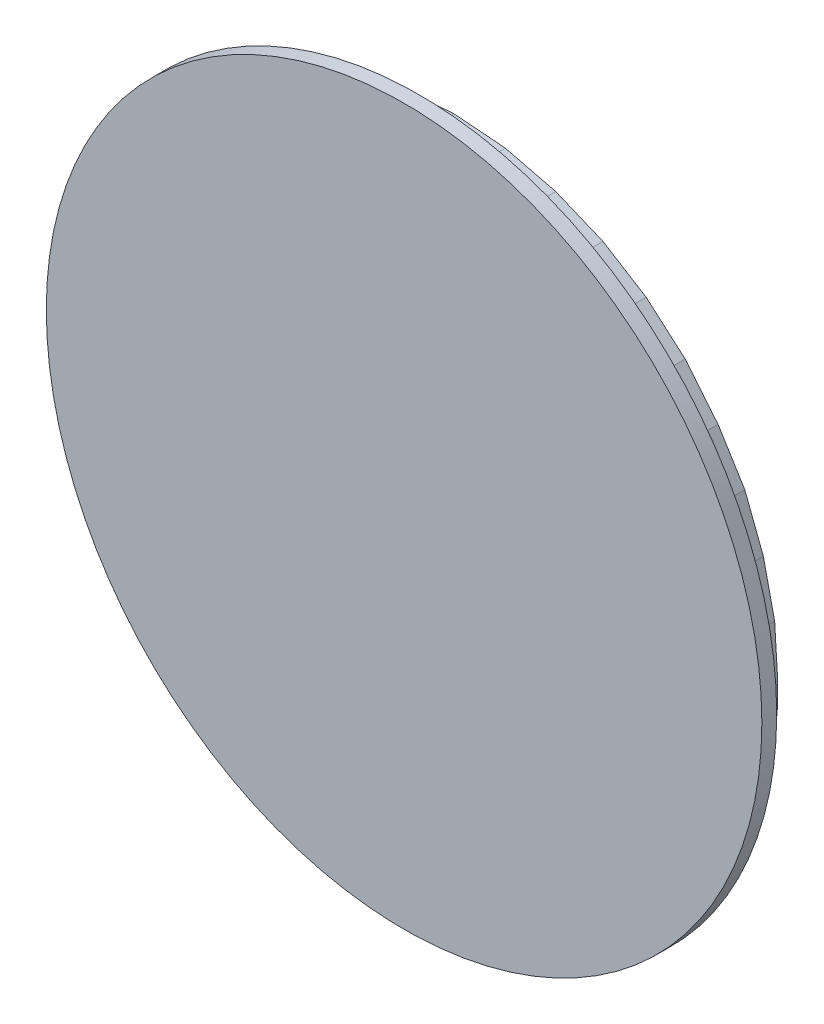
ISO-10303-21;
HEADER;
FILE_DESCRIPTION(('STEP AP214'),'2;1');
FILE_NAME('part.step','',(''),(''),'','','');
FILE_SCHEMA(('AUTOMOTIVE_DESIGN { 1 0 10303 214 1 1 1 1 }'));
ENDSEC;
DATA;
#1=APPLICATION_CONTEXT('core data for automotive mechanical design processes');
#2=APPLICATION_PROTOCOL_DEFINITION('international standard','automotive_design',2000,#1);
#3=PRODUCT_CONTEXT('',#1,'mechanical');
#4=PRODUCT('Part','Part','',(#3));
#5=PRODUCT_RELATED_PRODUCT_CATEGORY('part','',(#4));
#6=PRODUCT_DEFINITION_FORMATION('','',#4);
#7=PRODUCT_DEFINITION_CONTEXT('part definition',#1,'design');
#8=PRODUCT_DEFINITION('design','',#6,#7);
#9=PRODUCT_DEFINITION_SHAPE('','',#8);
#10=(LENGTH_UNIT() NAMED_UNIT(*) SI_UNIT(.MILLI.,.METRE.));
#11=(NAMED_UNIT(*) PLANE_ANGLE_UNIT() SI_UNIT($,.RADIAN.));
#12=(NAMED_UNIT(*) SI_UNIT($,.STERADIAN.) SOLID_ANGLE_UNIT());
#13=UNCERTAINTY_MEASURE_WITH_UNIT(LENGTH_MEASURE(1.E-05),#10,'distance_accuracy_value','');
#14=(GEOMETRIC_REPRESENTATION_CONTEXT(3) GLOBAL_UNCERTAINTY_ASSIGNED_CONTEXT((#13)) GLOBAL_UNIT_ASSIGNED_CONTEXT((#10,
#11,#12)) REPRESENTATION_CONTEXT('',''));
#15=CARTESIAN_POINT('',(0.,0.,0.));
#16=DIRECTION('',(0.,0.,1.));
#17=DIRECTION('',(1.,0.,0.));
#18=AXIS2_PLACEMENT_3D('',#15,#16,#17);
#19=CARTESIAN_POINT('',(0.,0.,12.8));
#20=DIRECTION('',(0.,0.,1.));
#21=DIRECTION('',(1.,0.,0.));
#22=AXIS2_PLACEMENT_3D('',#19,#20,#21);
#23=PLANE('',#22);
#24=CARTESIAN_POINT('',(0.,0.,12.8));
#25=DIRECTION('',(0.,0.,1.));
#26=DIRECTION('',(1.,0.,0.));
#27=AXIS2_PLACEMENT_3D('',#24,#25,#26);
#28=CIRCLE('',#27,26.5);
#29=CARTESIAN_POINT('',(26.5,0.,12.8));
#30=VERTEX_POINT('',#29);
#31=EDGE_CURVE('E44',#30,#30,#28,.T.);
#32=ORIENTED_EDGE('',*,*,#31,.F.);
#33=EDGE_LOOP('',(#32));
#34=FACE_BOUND('',#33,.T.);
#35=DIRECTION('',(0.951244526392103,0.308437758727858,0.));
#36=VECTOR('',#35,1.);
#37=CARTESIAN_POINT('',(7.91909,-24.97584,12.8));
#38=LINE('',#37,#36);
#39=CARTESIAN_POINT('',(5.10071,-25.88969,12.8));
#40=VERTEX_POINT('',#39);
#41=CARTESIAN_POINT('',(7.91909,-24.97584,12.8));
#42=VERTEX_POINT('',#41);
#43=EDGE_CURVE('E57',#40,#42,#38,.T.);
#44=ORIENTED_EDGE('',*,*,#43,.T.);
#45=DIRECTION('',(0.874098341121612,0.485748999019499,0.));
#46=VECTOR('',#45,1.);
#47=CARTESIAN_POINT('',(9.29046,-24.21375,12.8));
#48=LINE('',#47,#46);
#49=CARTESIAN_POINT('',(9.29046,-24.21375,12.8));
#50=VERTEX_POINT('',#49);
#51=EDGE_CURVE('E58',#42,#50,#48,.T.);
#52=ORIENTED_EDGE('',*,*,#51,.T.);
#53=DIRECTION('',(0.,1.,0.));
#54=VECTOR('',#53,1.);
#55=CARTESIAN_POINT('',(9.29046,-22.76387,12.8));
#56=LINE('',#55,#54);
#57=CARTESIAN_POINT('',(9.29046,-22.76387,12.8));
#58=VERTEX_POINT('',#57);
#59=EDGE_CURVE('E766',#50,#58,#56,.T.);
#60=ORIENTED_EDGE('',*,*,#59,.T.);
#61=DIRECTION('',(1.,0.,0.));
#62=VECTOR('',#61,1.);
#63=CARTESIAN_POINT('',(11.4215,-22.76387,12.8));
#64=LINE('',#63,#62);
#65=CARTESIAN_POINT('',(11.4215,-22.76387,12.8));
#66=VERTEX_POINT('',#65);
#67=EDGE_CURVE('E769',#58,#66,#64,.T.);
#68=ORIENTED_EDGE('',*,*,#67,.T.);
#69=DIRECTION('',(0.799837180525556,0.600217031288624,0.));
#70=VECTOR('',#69,1.);
#71=CARTESIAN_POINT('',(13.55584,-21.16221,12.8));
#72=LINE('',#71,#70);
#73=CARTESIAN_POINT('',(13.55584,-21.16221,12.8));
#74=VERTEX_POINT('',#73);
#75=EDGE_CURVE('E775',#66,#74,#72,.T.);
#76=ORIENTED_EDGE('',*,*,#75,.T.);
#77=DIRECTION('',(0.743968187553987,0.668215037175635,0.));
#78=VECTOR('',#77,1.);
#79=CARTESIAN_POINT('',(16.5255,-18.49493,12.8));
#80=LINE('',#79,#78);
#81=CARTESIAN_POINT('',(16.5255,-18.49493,12.8));
#82=VERTEX_POINT('',#81);
#83=EDGE_CURVE('E771',#74,#82,#80,.T.);
#84=ORIENTED_EDGE('',*,*,#83,.T.);
#85=DIRECTION('',(0.63736886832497,0.770558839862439,0.));
#86=VECTOR('',#85,1.);
#87=CARTESIAN_POINT('',(19.11369,-15.36589,12.8));
#88=LINE('',#87,#86);
#89=CARTESIAN_POINT('',(19.11369,-15.36589,12.8));
#90=VERTEX_POINT('',#89);
#91=EDGE_CURVE('E776',#82,#90,#88,.T.);
#92=ORIENTED_EDGE('',*,*,#91,.T.);
#93=DIRECTION('',(0.51408999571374,0.857736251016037,0.));
#94=VECTOR('',#93,1.);
#95=CARTESIAN_POINT('',(21.1691,-11.93653,12.8));
#96=LINE('',#95,#94);
#97=CARTESIAN_POINT('',(21.1691,-11.93653,12.8));
#98=VERTEX_POINT('',#97);
#99=EDGE_CURVE('E779',#90,#98,#96,.T.);
#100=ORIENTED_EDGE('',*,*,#99,.T.);
#101=DIRECTION('',(0.393708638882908,0.919235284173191,0.));
#102=VECTOR('',#101,1.);
#103=CARTESIAN_POINT('',(22.77066,-8.19719,12.8));
#104=LINE('',#103,#102);
#105=CARTESIAN_POINT('',(22.77066,-8.19719,12.8));
#106=VERTEX_POINT('',#105);
#107=EDGE_CURVE('E780',#98,#106,#104,.T.);
#108=ORIENTED_EDGE('',*,*,#107,.T.);
#109=DIRECTION('',(0.246736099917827,0.969082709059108,0.));
#110=VECTOR('',#109,1.);
#111=CARTESIAN_POINT('',(23.76055,-4.30929,12.8));
#112=LINE('',#111,#110);
#113=CARTESIAN_POINT('',(23.76055,-4.30929,12.8));
#114=VERTEX_POINT('',#113);
#115=EDGE_CURVE('E785',#106,#114,#112,.T.);
#116=ORIENTED_EDGE('',*,*,#115,.T.);
#117=DIRECTION('',(0.0955610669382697,0.995423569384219,0.));
#118=VECTOR('',#117,1.);
#119=CARTESIAN_POINT('',(23.98747,-1.94555,12.8));
#120=LINE('',#119,#118);
#121=CARTESIAN_POINT('',(23.98747,-1.94555,12.8));
#122=VERTEX_POINT('',#121);
#123=EDGE_CURVE('E782',#114,#122,#120,.T.);
#124=ORIENTED_EDGE('',*,*,#123,.T.);
#125=DIRECTION('',(0.,1.,0.));
#126=VECTOR('',#125,1.);
#127=CARTESIAN_POINT('',(23.98747,-0.4214,12.8));
#128=LINE('',#127,#126);
#129=CARTESIAN_POINT('',(23.98747,-0.4214,12.8));
#130=VERTEX_POINT('',#129);
#131=EDGE_CURVE('E787',#122,#130,#128,.T.);
#132=ORIENTED_EDGE('',*,*,#131,.T.);
#133=DIRECTION('',(-0.0606250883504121,0.998160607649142,0.));
#134=VECTOR('',#133,1.);
#135=CARTESIAN_POINT('',(23.76055,3.31472,12.8));
#136=LINE('',#135,#134);
#137=CARTESIAN_POINT('',(23.76055,3.31472,12.8));
#138=VERTEX_POINT('',#137);
#139=EDGE_CURVE('E786',#130,#138,#136,.T.);
#140=ORIENTED_EDGE('',*,*,#139,.T.);
#141=DIRECTION('',(-0.218828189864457,0.975763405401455,0.));
#142=VECTOR('',#141,1.);
#143=CARTESIAN_POINT('',(22.92195,7.05407,12.8));
#144=LINE('',#143,#142);
#145=CARTESIAN_POINT('',(22.92195,7.05407,12.8));
#146=VERTEX_POINT('',#145);
#147=EDGE_CURVE('E788',#138,#146,#144,.T.);
#148=ORIENTED_EDGE('',*,*,#147,.T.);
#149=DIRECTION('',(-0.357337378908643,0.933975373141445,0.));
#150=VECTOR('',#149,1.);
#151=CARTESIAN_POINT('',(21.55058,10.63843,12.8));
#152=LINE('',#151,#150);
#153=CARTESIAN_POINT('',(21.55058,10.63843,12.8));
#154=VERTEX_POINT('',#153);
#155=EDGE_CURVE('E792',#146,#154,#152,.T.);
#156=ORIENTED_EDGE('',*,*,#155,.T.);
#157=DIRECTION('',(-0.526119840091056,0.850410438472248,0.));
#158=VECTOR('',#157,1.);
#159=CARTESIAN_POINT('',(19.5708,13.83851,12.8));
#160=LINE('',#159,#158);
#161=CARTESIAN_POINT('',(19.5708,13.83851,12.8));
#162=VERTEX_POINT('',#161);
#163=EDGE_CURVE('E793',#154,#162,#160,.T.);
#164=ORIENTED_EDGE('',*,*,#163,.T.);
#165=DIRECTION('',(-0.633794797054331,0.773501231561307,0.));
#166=VECTOR('',#165,1.);
#167=CARTESIAN_POINT('',(17.13391,16.81256,12.8));
#168=LINE('',#167,#166);
#169=CARTESIAN_POINT('',(17.13391,16.81256,12.8));
#170=VERTEX_POINT('',#169);
#171=EDGE_CURVE('E796',#162,#170,#168,.T.);
#172=ORIENTED_EDGE('',*,*,#171,.T.);
#173=DIRECTION('',(-0.754321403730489,0.656505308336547,0.));
#174=VECTOR('',#173,1.);
#175=CARTESIAN_POINT('',(14.23989,19.3313,12.8));
#176=LINE('',#175,#174);
#177=CARTESIAN_POINT('',(14.23989,19.3313,12.8));
#178=VERTEX_POINT('',#177);
#179=EDGE_CURVE('E798',#170,#178,#176,.T.);
#180=ORIENTED_EDGE('',*,*,#179,.T.);
#181=DIRECTION('',(-0.849804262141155,0.527098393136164,0.));
#182=VECTOR('',#181,1.);
#183=CARTESIAN_POINT('',(11.04332,21.314,12.8));
#184=LINE('',#183,#182);
#185=CARTESIAN_POINT('',(11.04332,21.314,12.8));
#186=VERTEX_POINT('',#185);
#187=EDGE_CURVE('E799',#178,#186,#184,.T.);
#188=ORIENTED_EDGE('',*,*,#187,.T.);
#189=DIRECTION('',(-0.924261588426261,0.381759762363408,0.));
#190=VECTOR('',#189,1.);
#191=CARTESIAN_POINT('',(7.5409,22.76065,12.8));
#192=LINE('',#191,#190);
#193=CARTESIAN_POINT('',(7.5409,22.76065,12.8));
#194=VERTEX_POINT('',#193);
#195=EDGE_CURVE('E802',#186,#194,#192,.T.);
#196=ORIENTED_EDGE('',*,*,#195,.T.);
#197=DIRECTION('',(-0.971118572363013,0.238597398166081,0.));
#198=VECTOR('',#197,1.);
#199=CARTESIAN_POINT('',(3.80828,23.67773,12.8));
#200=LINE('',#199,#198);
#201=CARTESIAN_POINT('',(3.80828,23.67773,12.8));
#202=VERTEX_POINT('',#201);
#203=EDGE_CURVE('E805',#194,#202,#200,.T.);
#204=ORIENTED_EDGE('',*,*,#203,.T.);
#205=DIRECTION('',(-0.996838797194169,0.0794506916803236,0.));
#206=VECTOR('',#205,1.);
#207=CARTESIAN_POINT('',(0.,23.98126,12.8));
#208=LINE('',#207,#206);
#209=CARTESIAN_POINT('',(0.,23.98126,12.8));
#210=VERTEX_POINT('',#209);
#211=EDGE_CURVE('E808',#202,#210,#208,.T.);
#212=ORIENTED_EDGE('',*,*,#211,.T.);
#213=DIRECTION('',(-0.996833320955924,-0.0795193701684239,0.));
#214=VECTOR('',#213,1.);
#215=CARTESIAN_POINT('',(-3.80497,23.67773,12.8));
#216=LINE('',#215,#214);
#217=CARTESIAN_POINT('',(-3.80497,23.67773,12.8));
#218=VERTEX_POINT('',#217);
#219=EDGE_CURVE('E806',#210,#218,#216,.T.);
#220=ORIENTED_EDGE('',*,*,#219,.T.);
#221=DIRECTION('',(-0.96996547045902,-0.243242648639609,0.));
#222=VECTOR('',#221,1.);
#223=CARTESIAN_POINT('',(-7.46196,22.76065,12.8));
#224=LINE('',#223,#222);
#225=CARTESIAN_POINT('',(-7.46196,22.76065,12.8));
#226=VERTEX_POINT('',#225);
#227=EDGE_CURVE('E807',#218,#226,#224,.T.);
#228=ORIENTED_EDGE('',*,*,#227,.T.);
#229=DIRECTION('',(-0.924261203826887,-0.381760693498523,0.));
#230=VECTOR('',#229,1.);
#231=CARTESIAN_POINT('',(-10.96437,21.314,12.8));
#232=LINE('',#231,#230);
#233=CARTESIAN_POINT('',(-10.96437,21.314,12.8));
#234=VERTEX_POINT('',#233);
#235=EDGE_CURVE('E815',#226,#234,#232,.T.);
#236=ORIENTED_EDGE('',*,*,#235,.T.);
#237=DIRECTION('',(-0.855482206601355,-0.51783220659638,0.));
#238=VECTOR('',#237,1.);
#239=CARTESIAN_POINT('',(-14.23988,19.3313,12.8));
#240=LINE('',#239,#238);
#241=CARTESIAN_POINT('',(-14.23988,19.3313,12.8));
#242=VERTEX_POINT('',#241);
#243=EDGE_CURVE('E812',#234,#242,#240,.T.);
#244=ORIENTED_EDGE('',*,*,#243,.T.);
#245=DIRECTION('',(-0.75432140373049,-0.656505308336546,0.));
#246=VECTOR('',#245,1.);
#247=CARTESIAN_POINT('',(-17.1339,16.81256,12.8));
#248=LINE('',#247,#246);
#249=CARTESIAN_POINT('',(-17.1339,16.81256,12.8));
#250=VERTEX_POINT('',#249);
#251=EDGE_CURVE('E816',#242,#250,#248,.T.);
#252=ORIENTED_EDGE('',*,*,#251,.T.);
#253=DIRECTION('',(-0.633794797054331,-0.773501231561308,0.));
#254=VECTOR('',#253,1.);
#255=CARTESIAN_POINT('',(-19.57079,13.83851,12.8));
#256=LINE('',#255,#254);
#257=CARTESIAN_POINT('',(-19.57079,13.83851,12.8));
#258=VERTEX_POINT('',#257);
#259=EDGE_CURVE('E818',#250,#258,#256,.T.);
#260=ORIENTED_EDGE('',*,*,#259,.T.);
#261=DIRECTION('',(-0.511349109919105,-0.859373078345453,0.));
#262=VECTOR('',#261,1.);
#263=CARTESIAN_POINT('',(-21.47492,10.63843,12.8));
#264=LINE('',#263,#262);
#265=CARTESIAN_POINT('',(-21.47492,10.63843,12.8));
#266=VERTEX_POINT('',#265);
#267=EDGE_CURVE('E819',#258,#266,#264,.T.);
#268=ORIENTED_EDGE('',*,*,#267,.T.);
#269=DIRECTION('',(-0.374347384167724,-0.927288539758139,0.));
#270=VECTOR('',#269,1.);
#271=CARTESIAN_POINT('',(-22.92193,7.05407,12.8));
#272=LINE('',#271,#270);
#273=CARTESIAN_POINT('',(-22.92193,7.05407,12.8));
#274=VERTEX_POINT('',#273);
#275=EDGE_CURVE('E825',#266,#274,#272,.T.);
#276=ORIENTED_EDGE('',*,*,#275,.T.);
#277=DIRECTION('',(-0.218015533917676,-0.975945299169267,0.));
#278=VECTOR('',#277,1.);
#279=CARTESIAN_POINT('',(-23.75726,3.31472,12.8));
#280=LINE('',#279,#278);
#281=CARTESIAN_POINT('',(-23.75726,3.31472,12.8));
#282=VERTEX_POINT('',#281);
#283=EDGE_CURVE('E823',#274,#282,#280,.T.);
#284=ORIENTED_EDGE('',*,*,#283,.T.);
#285=DIRECTION('',(-0.0614980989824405,-0.998107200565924,0.));
#286=VECTOR('',#285,1.);
#287=CARTESIAN_POINT('',(-23.98746,-0.4214,12.8));
#288=LINE('',#287,#286);
#289=CARTESIAN_POINT('',(-23.98746,-0.4214,12.8));
#290=VERTEX_POINT('',#289);
#291=EDGE_CURVE('E827',#282,#290,#288,.T.);
#292=ORIENTED_EDGE('',*,*,#291,.T.);
#293=DIRECTION('',(0.,-1.,0.));
#294=VECTOR('',#293,1.);
#295=CARTESIAN_POINT('',(-23.98746,-1.94555,12.8));
#296=LINE('',#295,#294);
#297=CARTESIAN_POINT('',(-23.98746,-1.94555,12.8));
#298=VERTEX_POINT('',#297);
#299=EDGE_CURVE('E829',#290,#298,#296,.T.);
#300=ORIENTED_EDGE('',*,*,#299,.T.);
#301=DIRECTION('',(0.0955568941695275,-0.995423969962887,0.));
#302=VECTOR('',#301,1.);
#303=CARTESIAN_POINT('',(-23.76055,-4.30929,12.8));
#304=LINE('',#303,#302);
#305=CARTESIAN_POINT('',(-23.76055,-4.30929,12.8));
#306=VERTEX_POINT('',#305);
#307=EDGE_CURVE('E828',#298,#306,#304,.T.);
#308=ORIENTED_EDGE('',*,*,#307,.T.);
#309=DIRECTION('',(0.265072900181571,-0.96422837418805,0.));
#310=VECTOR('',#309,1.);
#311=CARTESIAN_POINT('',(-22.69174,-8.19719,12.8));
#312=LINE('',#311,#310);
#313=CARTESIAN_POINT('',(-22.69174,-8.19719,12.8));
#314=VERTEX_POINT('',#313);
#315=EDGE_CURVE('E832',#306,#314,#312,.T.);
#316=ORIENTED_EDGE('',*,*,#315,.T.);
#317=DIRECTION('',(0.377134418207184,-0.926158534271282,0.));
#318=VECTOR('',#317,1.);
#319=CARTESIAN_POINT('',(-21.16907,-11.93653,12.8));
#320=LINE('',#319,#318);
#321=CARTESIAN_POINT('',(-21.16907,-11.93653,12.8));
#322=VERTEX_POINT('',#321);
#323=EDGE_CURVE('E833',#314,#322,#320,.T.);
#324=ORIENTED_EDGE('',*,*,#323,.T.);
#325=DIRECTION('',(0.527804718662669,-0.849365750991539,0.));
#326=VECTOR('',#325,1.);
#327=CARTESIAN_POINT('',(-19.03803,-15.36589,12.8));
#328=LINE('',#327,#326);
#329=CARTESIAN_POINT('',(-19.03803,-15.36589,12.8));
#330=VERTEX_POINT('',#329);
#331=EDGE_CURVE('E836',#322,#330,#328,.T.);
#332=ORIENTED_EDGE('',*,*,#331,.T.);
#333=DIRECTION('',(0.626106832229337,-0.779737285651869,0.));
#334=VECTOR('',#333,1.);
#335=CARTESIAN_POINT('',(-16.5255,-18.49493,12.8));
#336=LINE('',#335,#334);
#337=CARTESIAN_POINT('',(-16.5255,-18.49493,12.8));
#338=VERTEX_POINT('',#337);
#339=EDGE_CURVE('E838',#330,#338,#336,.T.);
#340=ORIENTED_EDGE('',*,*,#339,.T.);
#341=DIRECTION('',(0.752253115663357,-0.658874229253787,0.));
#342=VECTOR('',#341,1.);
#343=CARTESIAN_POINT('',(-13.4802,-21.16221,12.8));
#344=LINE('',#343,#342);
#345=CARTESIAN_POINT('',(-13.4802,-21.16221,12.8));
#346=VERTEX_POINT('',#345);
#347=EDGE_CURVE('E839',#338,#346,#344,.T.);
#348=ORIENTED_EDGE('',*,*,#347,.T.);
#349=DIRECTION('',(0.799835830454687,-0.600218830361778,0.));
#350=VECTOR('',#349,1.);
#351=CARTESIAN_POINT('',(-11.34587,-22.76387,12.8));
#352=LINE('',#351,#350);
#353=CARTESIAN_POINT('',(-11.34587,-22.76387,12.8));
#354=VERTEX_POINT('',#353);
#355=EDGE_CURVE('E845',#346,#354,#352,.T.);
#356=ORIENTED_EDGE('',*,*,#355,.T.);
#357=DIRECTION('',(1.,0.,0.));
#358=VECTOR('',#357,1.);
#359=CARTESIAN_POINT('',(-9.21482,-22.76387,12.8));
#360=LINE('',#359,#358);
#361=CARTESIAN_POINT('',(-9.21482,-22.76387,12.8));
#362=VERTEX_POINT('',#361);
#363=EDGE_CURVE('E844',#354,#362,#360,.T.);
#364=ORIENTED_EDGE('',*,*,#363,.T.);
#365=DIRECTION('',(0.,-1.,0.));
#366=VECTOR('',#365,1.);
#367=CARTESIAN_POINT('',(-9.21482,-24.21375,12.8));
#368=LINE('',#367,#366);
#369=CARTESIAN_POINT('',(-9.21482,-24.21375,12.8));
#370=VERTEX_POINT('',#369);
#371=EDGE_CURVE('E846',#362,#370,#368,.T.);
#372=ORIENTED_EDGE('',*,*,#371,.T.);
#373=DIRECTION('',(0.861964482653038,-0.506968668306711,0.));
#374=VECTOR('',#373,1.);
#375=CARTESIAN_POINT('',(-7.91909,-24.97584,12.8));
#376=LINE('',#375,#374);
#377=CARTESIAN_POINT('',(-7.91909,-24.97584,12.8));
#378=VERTEX_POINT('',#377);
#379=EDGE_CURVE('E329',#370,#378,#376,.T.);
#380=ORIENTED_EDGE('',*,*,#379,.T.);
#381=DIRECTION('',(0.951244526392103,-0.308437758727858,0.));
#382=VECTOR('',#381,1.);
#383=CARTESIAN_POINT('',(-5.10071,-25.88969,12.8));
#384=LINE('',#383,#382);
#385=CARTESIAN_POINT('',(-5.10071,-25.88969,12.8));
#386=VERTEX_POINT('',#385);
#387=EDGE_CURVE('E322',#378,#386,#384,.T.);
#388=ORIENTED_EDGE('',*,*,#387,.T.);
#389=DIRECTION('',(1.,0.,0.));
#390=VECTOR('',#389,1.);
#391=CARTESIAN_POINT('',(5.10071,-25.88969,12.8));
#392=LINE('',#391,#390);
#393=EDGE_CURVE('E330',#386,#40,#392,.T.);
#394=ORIENTED_EDGE('',*,*,#393,.T.);
#395=EDGE_LOOP('',(#44,#52,#60,#68,#76,#84,#92,#100,#108,#116,#124,#132,#140,#148,#156,#164,
#172,#180,#188,#196,#204,#212,#220,#228,#236,#244,#252,#260,#268,#276,#284,#292,#300,#308,#316,
#324,#332,#340,#348,#356,#364,#372,#380,#388,#394));
#396=FACE_BOUND('',#395,.T.);
#397=ADVANCED_FACE('F41',(#34,#396),#23,.F.);
#398=CARTESIAN_POINT('',(0.,0.,13.9));
#399=DIRECTION('',(0.,0.,-1.));
#400=DIRECTION('',(-1.,0.,0.));
#401=AXIS2_PLACEMENT_3D('',#398,#399,#400);
#402=CYLINDRICAL_SURFACE('',#401,26.5);
#403=CARTESIAN_POINT('',(0.,0.,13.9));
#404=DIRECTION('',(0.,0.,1.));
#405=DIRECTION('',(1.,0.,0.));
#406=AXIS2_PLACEMENT_3D('',#403,#404,#405);
#407=CIRCLE('',#406,26.5);
#408=CARTESIAN_POINT('',(26.5,0.,13.9));
#409=VERTEX_POINT('',#408);
#410=EDGE_CURVE('E11',#409,#409,#407,.T.);
#411=ORIENTED_EDGE('',*,*,#410,.F.);
#412=EDGE_LOOP('',(#411));
#413=FACE_BOUND('',#412,.T.);
#414=ORIENTED_EDGE('',*,*,#31,.T.);
#415=EDGE_LOOP('',(#414));
#416=FACE_BOUND('',#415,.T.);
#417=ADVANCED_FACE('F43',(#413,#416),#402,.T.);
#418=CARTESIAN_POINT('',(0.,0.,13.9));
#419=DIRECTION('',(0.,0.,1.));
#420=DIRECTION('',(1.,0.,0.));
#421=AXIS2_PLACEMENT_3D('',#418,#419,#420);
#422=PLANE('',#421);
#423=ORIENTED_EDGE('',*,*,#410,.T.);
#424=EDGE_LOOP('',(#423));
#425=FACE_BOUND('',#424,.T.);
#426=ADVANCED_FACE('F577',(#425),#422,.T.);
#427=CARTESIAN_POINT('',(7.91909,-24.97584,12.8));
#428=DIRECTION('',(-0.308437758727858,0.951244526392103,0.));
#429=DIRECTION('',(-0.951244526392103,-0.308437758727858,0.));
#430=AXIS2_PLACEMENT_3D('',#427,#428,#429);
#431=PLANE('',#430);
#432=DIRECTION('',(0.951244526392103,0.308437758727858,0.));
#433=VECTOR('',#432,1.);
#434=CARTESIAN_POINT('',(7.91909,-24.97584,10.215));
#435=LINE('',#434,#433);
#436=CARTESIAN_POINT('',(5.10071,-25.88969,10.215));
#437=VERTEX_POINT('',#436);
#438=CARTESIAN_POINT('',(7.91909,-24.97584,10.215));
#439=VERTEX_POINT('',#438);
#440=EDGE_CURVE('E351',#437,#439,#435,.T.);
#441=ORIENTED_EDGE('',*,*,#440,.T.);
#442=DIRECTION('',(0.,0.,-1.));
#443=VECTOR('',#442,1.);
#444=CARTESIAN_POINT('',(7.91909,-24.97584,12.8));
#445=LINE('',#444,#443);
#446=EDGE_CURVE('E564',#42,#439,#445,.T.);
#447=ORIENTED_EDGE('',*,*,#446,.F.);
#448=ORIENTED_EDGE('',*,*,#43,.F.);
#449=DIRECTION('',(0.,0.,-1.));
#450=VECTOR('',#449,1.);
#451=CARTESIAN_POINT('',(5.10071,-25.88969,12.8));
#452=LINE('',#451,#450);
#453=EDGE_CURVE('E343',#40,#437,#452,.T.);
#454=ORIENTED_EDGE('',*,*,#453,.T.);
#455=EDGE_LOOP('',(#441,#447,#448,#454));
#456=FACE_BOUND('',#455,.T.);
#457=ADVANCED_FACE('F581',(#456),#431,.F.);
#458=CARTESIAN_POINT('',(9.29046,-24.21375,12.8));
#459=DIRECTION('',(-0.485748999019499,0.874098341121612,0.));
#460=DIRECTION('',(-0.874098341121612,-0.485748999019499,0.));
#461=AXIS2_PLACEMENT_3D('',#458,#459,#460);
#462=PLANE('',#461);
#463=DIRECTION('',(0.874098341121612,0.485748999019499,0.));
#464=VECTOR('',#463,1.);
#465=CARTESIAN_POINT('',(9.29046,-24.21375,10.215));
#466=LINE('',#465,#464);
#467=CARTESIAN_POINT('',(9.29046,-24.21375,10.215));
#468=VERTEX_POINT('',#467);
#469=EDGE_CURVE('E353',#439,#468,#466,.T.);
#470=ORIENTED_EDGE('',*,*,#469,.T.);
#471=DIRECTION('',(0.,0.,-1.));
#472=VECTOR('',#471,1.);
#473=CARTESIAN_POINT('',(9.29046,-24.21375,12.8));
#474=LINE('',#473,#472);
#475=EDGE_CURVE('E565',#50,#468,#474,.T.);
#476=ORIENTED_EDGE('',*,*,#475,.F.);
#477=ORIENTED_EDGE('',*,*,#51,.F.);
#478=ORIENTED_EDGE('',*,*,#446,.T.);
#479=EDGE_LOOP('',(#470,#476,#477,#478));
#480=FACE_BOUND('',#479,.T.);
#481=ADVANCED_FACE('F588',(#480),#462,.F.);
#482=CARTESIAN_POINT('',(9.29046,-22.76387,12.8));
#483=DIRECTION('',(-1.,0.,0.));
#484=DIRECTION('',(0.,0.,1.));
#485=AXIS2_PLACEMENT_3D('',#482,#483,#484);
#486=PLANE('',#485);
#487=DIRECTION('',(0.,1.,0.));
#488=VECTOR('',#487,1.);
#489=CARTESIAN_POINT('',(9.29046,-22.76387,10.215));
#490=LINE('',#489,#488);
#491=CARTESIAN_POINT('',(9.29046,-22.76387,10.215));
#492=VERTEX_POINT('',#491);
#493=EDGE_CURVE('E356',#468,#492,#490,.T.);
#494=ORIENTED_EDGE('',*,*,#493,.T.);
#495=DIRECTION('',(0.,0.,-1.));
#496=VECTOR('',#495,1.);
#497=CARTESIAN_POINT('',(9.29046,-22.76387,12.8));
#498=LINE('',#497,#496);
#499=EDGE_CURVE('E558',#58,#492,#498,.T.);
#500=ORIENTED_EDGE('',*,*,#499,.F.);
#501=ORIENTED_EDGE('',*,*,#59,.F.);
#502=ORIENTED_EDGE('',*,*,#475,.T.);
#503=EDGE_LOOP('',(#494,#500,#501,#502));
#504=FACE_BOUND('',#503,.T.);
#505=ADVANCED_FACE('F587',(#504),#486,.F.);
#506=CARTESIAN_POINT('',(11.4215,-22.76387,12.8));
#507=DIRECTION('',(0.,1.,0.));
#508=DIRECTION('',(0.,0.,1.));
#509=AXIS2_PLACEMENT_3D('',#506,#507,#508);
#510=PLANE('',#509);
#511=DIRECTION('',(1.,0.,0.));
#512=VECTOR('',#511,1.);
#513=CARTESIAN_POINT('',(11.4215,-22.76387,10.215));
#514=LINE('',#513,#512);
#515=CARTESIAN_POINT('',(11.4215,-22.76387,10.215));
#516=VERTEX_POINT('',#515);
#517=EDGE_CURVE('E358',#492,#516,#514,.T.);
#518=ORIENTED_EDGE('',*,*,#517,.T.);
#519=DIRECTION('',(0.,0.,-1.));
#520=VECTOR('',#519,1.);
#521=CARTESIAN_POINT('',(11.4215,-22.76387,12.8));
#522=LINE('',#521,#520);
#523=EDGE_CURVE('E556',#66,#516,#522,.T.);
#524=ORIENTED_EDGE('',*,*,#523,.F.);
#525=ORIENTED_EDGE('',*,*,#67,.F.);
#526=ORIENTED_EDGE('',*,*,#499,.T.);
#527=EDGE_LOOP('',(#518,#524,#525,#526));
#528=FACE_BOUND('',#527,.T.);
#529=ADVANCED_FACE('F593',(#528),#510,.F.);
#530=CARTESIAN_POINT('',(13.55584,-21.16221,12.8));
#531=DIRECTION('',(-0.600217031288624,0.799837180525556,0.));
#532=DIRECTION('',(-0.799837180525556,-0.600217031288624,0.));
#533=AXIS2_PLACEMENT_3D('',#530,#531,#532);
#534=PLANE('',#533);
#535=DIRECTION('',(0.799837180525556,0.600217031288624,0.));
#536=VECTOR('',#535,1.);
#537=CARTESIAN_POINT('',(13.55584,-21.16221,10.215));
#538=LINE('',#537,#536);
#539=CARTESIAN_POINT('',(13.55584,-21.16221,10.215));
#540=VERTEX_POINT('',#539);
#541=EDGE_CURVE('E359',#516,#540,#538,.T.);
#542=ORIENTED_EDGE('',*,*,#541,.T.);
#543=DIRECTION('',(0.,0.,-1.));
#544=VECTOR('',#543,1.);
#545=CARTESIAN_POINT('',(13.55584,-21.16221,12.8));
#546=LINE('',#545,#544);
#547=EDGE_CURVE('E554',#74,#540,#546,.T.);
#548=ORIENTED_EDGE('',*,*,#547,.F.);
#549=ORIENTED_EDGE('',*,*,#75,.F.);
#550=ORIENTED_EDGE('',*,*,#523,.T.);
#551=EDGE_LOOP('',(#542,#548,#549,#550));
#552=FACE_BOUND('',#551,.T.);
#553=ADVANCED_FACE('F600',(#552),#534,.F.);
#554=CARTESIAN_POINT('',(16.5255,-18.49493,12.8));
#555=DIRECTION('',(-0.668215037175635,0.743968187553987,0.));
#556=DIRECTION('',(-0.743968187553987,-0.668215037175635,0.));
#557=AXIS2_PLACEMENT_3D('',#554,#555,#556);
#558=PLANE('',#557);
#559=DIRECTION('',(0.743968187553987,0.668215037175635,0.));
#560=VECTOR('',#559,1.);
#561=CARTESIAN_POINT('',(16.5255,-18.49493,10.215));
#562=LINE('',#561,#560);
#563=CARTESIAN_POINT('',(16.5255,-18.49493,10.215));
#564=VERTEX_POINT('',#563);
#565=EDGE_CURVE('E362',#540,#564,#562,.T.);
#566=ORIENTED_EDGE('',*,*,#565,.T.);
#567=DIRECTION('',(0.,0.,-1.));
#568=VECTOR('',#567,1.);
#569=CARTESIAN_POINT('',(16.5255,-18.49493,12.8));
#570=LINE('',#569,#568);
#571=EDGE_CURVE('E549',#82,#564,#570,.T.);
#572=ORIENTED_EDGE('',*,*,#571,.F.);
#573=ORIENTED_EDGE('',*,*,#83,.F.);
#574=ORIENTED_EDGE('',*,*,#547,.T.);
#575=EDGE_LOOP('',(#566,#572,#573,#574));
#576=FACE_BOUND('',#575,.T.);
#577=ADVANCED_FACE('F601',(#576),#558,.F.);
#578=CARTESIAN_POINT('',(19.11369,-15.36589,12.8));
#579=DIRECTION('',(-0.770558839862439,0.63736886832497,0.));
#580=DIRECTION('',(-0.63736886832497,-0.770558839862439,0.));
#581=AXIS2_PLACEMENT_3D('',#578,#579,#580);
#582=PLANE('',#581);
#583=DIRECTION('',(0.63736886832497,0.770558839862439,0.));
#584=VECTOR('',#583,1.);
#585=CARTESIAN_POINT('',(19.11369,-15.36589,10.215));
#586=LINE('',#585,#584);
#587=CARTESIAN_POINT('',(19.11369,-15.36589,10.215));
#588=VERTEX_POINT('',#587);
#589=EDGE_CURVE('E365',#564,#588,#586,.T.);
#590=ORIENTED_EDGE('',*,*,#589,.T.);
#591=DIRECTION('',(0.,0.,-1.));
#592=VECTOR('',#591,1.);
#593=CARTESIAN_POINT('',(19.11369,-15.36589,12.8));
#594=LINE('',#593,#592);
#595=EDGE_CURVE('E550',#90,#588,#594,.T.);
#596=ORIENTED_EDGE('',*,*,#595,.F.);
#597=ORIENTED_EDGE('',*,*,#91,.F.);
#598=ORIENTED_EDGE('',*,*,#571,.T.);
#599=EDGE_LOOP('',(#590,#596,#597,#598));
#600=FACE_BOUND('',#599,.T.);
#601=ADVANCED_FACE('F604',(#600),#582,.F.);
#602=CARTESIAN_POINT('',(21.1691,-11.93653,12.8));
#603=DIRECTION('',(-0.857736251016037,0.51408999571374,0.));
#604=DIRECTION('',(-0.51408999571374,-0.857736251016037,0.));
#605=AXIS2_PLACEMENT_3D('',#602,#603,#604);
#606=PLANE('',#605);
#607=DIRECTION('',(0.51408999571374,0.857736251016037,0.));
#608=VECTOR('',#607,1.);
#609=CARTESIAN_POINT('',(21.1691,-11.93653,10.215));
#610=LINE('',#609,#608);
#611=CARTESIAN_POINT('',(21.1691,-11.93653,10.215));
#612=VERTEX_POINT('',#611);
#613=EDGE_CURVE('E368',#588,#612,#610,.T.);
#614=ORIENTED_EDGE('',*,*,#613,.T.);
#615=DIRECTION('',(0.,0.,-1.));
#616=VECTOR('',#615,1.);
#617=CARTESIAN_POINT('',(21.1691,-11.93653,12.8));
#618=LINE('',#617,#616);
#619=EDGE_CURVE('E542',#98,#612,#618,.T.);
#620=ORIENTED_EDGE('',*,*,#619,.F.);
#621=ORIENTED_EDGE('',*,*,#99,.F.);
#622=ORIENTED_EDGE('',*,*,#595,.T.);
#623=EDGE_LOOP('',(#614,#620,#621,#622));
#624=FACE_BOUND('',#623,.T.);
#625=ADVANCED_FACE('F606',(#624),#606,.F.);
#626=CARTESIAN_POINT('',(22.77066,-8.19719,12.8));
#627=DIRECTION('',(-0.919235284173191,0.393708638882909,0.));
#628=DIRECTION('',(-0.393708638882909,-0.919235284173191,0.));
#629=AXIS2_PLACEMENT_3D('',#626,#627,#628);
#630=PLANE('',#629);
#631=DIRECTION('',(0.393708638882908,0.919235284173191,0.));
#632=VECTOR('',#631,1.);
#633=CARTESIAN_POINT('',(22.77066,-8.19719,10.215));
#634=LINE('',#633,#632);
#635=CARTESIAN_POINT('',(22.77066,-8.19719,10.215));
#636=VERTEX_POINT('',#635);
#637=EDGE_CURVE('E366',#612,#636,#634,.T.);
#638=ORIENTED_EDGE('',*,*,#637,.T.);
#639=DIRECTION('',(0.,0.,-1.));
#640=VECTOR('',#639,1.);
#641=CARTESIAN_POINT('',(22.77066,-8.19719,12.8));
#642=LINE('',#641,#640);
#643=EDGE_CURVE('E541',#106,#636,#642,.T.);
#644=ORIENTED_EDGE('',*,*,#643,.F.);
#645=ORIENTED_EDGE('',*,*,#107,.F.);
#646=ORIENTED_EDGE('',*,*,#619,.T.);
#647=EDGE_LOOP('',(#638,#644,#645,#646));
#648=FACE_BOUND('',#647,.T.);
#649=ADVANCED_FACE('F614',(#648),#630,.F.);
#650=CARTESIAN_POINT('',(23.76055,-4.30929,12.8));
#651=DIRECTION('',(-0.969082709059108,0.246736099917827,0.));
#652=DIRECTION('',(-0.246736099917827,-0.969082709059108,0.));
#653=AXIS2_PLACEMENT_3D('',#650,#651,#652);
#654=PLANE('',#653);
#655=DIRECTION('',(0.246736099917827,0.969082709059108,0.));
#656=VECTOR('',#655,1.);
#657=CARTESIAN_POINT('',(23.76055,-4.30929,10.215));
#658=LINE('',#657,#656);
#659=CARTESIAN_POINT('',(23.76055,-4.30929,10.215));
#660=VERTEX_POINT('',#659);
#661=EDGE_CURVE('E367',#636,#660,#658,.T.);
#662=ORIENTED_EDGE('',*,*,#661,.T.);
#663=DIRECTION('',(0.,0.,-1.));
#664=VECTOR('',#663,1.);
#665=CARTESIAN_POINT('',(23.76055,-4.30929,12.8));
#666=LINE('',#665,#664);
#667=EDGE_CURVE('E538',#114,#660,#666,.T.);
#668=ORIENTED_EDGE('',*,*,#667,.F.);
#669=ORIENTED_EDGE('',*,*,#115,.F.);
#670=ORIENTED_EDGE('',*,*,#643,.T.);
#671=EDGE_LOOP('',(#662,#668,#669,#670));
#672=FACE_BOUND('',#671,.T.);
#673=ADVANCED_FACE('F620',(#672),#654,.F.);
#674=CARTESIAN_POINT('',(23.98747,-1.94555,12.8));
#675=DIRECTION('',(-0.995423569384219,0.0955610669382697,0.));
#676=DIRECTION('',(-0.0955610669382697,-0.995423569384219,0.));
#677=AXIS2_PLACEMENT_3D('',#674,#675,#676);
#678=PLANE('',#677);
#679=DIRECTION('',(0.0955610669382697,0.995423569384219,0.));
#680=VECTOR('',#679,1.);
#681=CARTESIAN_POINT('',(23.98747,-1.94555,10.215));
#682=LINE('',#681,#680);
#683=CARTESIAN_POINT('',(23.98747,-1.94555,10.215));
#684=VERTEX_POINT('',#683);
#685=EDGE_CURVE('E375',#660,#684,#682,.T.);
#686=ORIENTED_EDGE('',*,*,#685,.T.);
#687=DIRECTION('',(0.,0.,-1.));
#688=VECTOR('',#687,1.);
#689=CARTESIAN_POINT('',(23.98747,-1.94555,12.8));
#690=LINE('',#689,#688);
#691=EDGE_CURVE('E532',#122,#684,#690,.T.);
#692=ORIENTED_EDGE('',*,*,#691,.F.);
#693=ORIENTED_EDGE('',*,*,#123,.F.);
#694=ORIENTED_EDGE('',*,*,#667,.T.);
#695=EDGE_LOOP('',(#686,#692,#693,#694));
#696=FACE_BOUND('',#695,.T.);
#697=ADVANCED_FACE('F622',(#696),#678,.F.);
#698=CARTESIAN_POINT('',(23.98747,-0.4214,12.8));
#699=DIRECTION('',(-1.,0.,0.));
#700=DIRECTION('',(0.,0.,1.));
#701=AXIS2_PLACEMENT_3D('',#698,#699,#700);
#702=PLANE('',#701);
#703=DIRECTION('',(0.,1.,0.));
#704=VECTOR('',#703,1.);
#705=CARTESIAN_POINT('',(23.98747,-0.4214,10.215));
#706=LINE('',#705,#704);
#707=CARTESIAN_POINT('',(23.98747,-0.4214,10.215));
#708=VERTEX_POINT('',#707);
#709=EDGE_CURVE('E372',#684,#708,#706,.T.);
#710=ORIENTED_EDGE('',*,*,#709,.T.);
#711=DIRECTION('',(0.,0.,-1.));
#712=VECTOR('',#711,1.);
#713=CARTESIAN_POINT('',(23.98747,-0.4214,12.8));
#714=LINE('',#713,#712);
#715=EDGE_CURVE('E535',#130,#708,#714,.T.);
#716=ORIENTED_EDGE('',*,*,#715,.F.);
#717=ORIENTED_EDGE('',*,*,#131,.F.);
#718=ORIENTED_EDGE('',*,*,#691,.T.);
#719=EDGE_LOOP('',(#710,#716,#717,#718));
#720=FACE_BOUND('',#719,.T.);
#721=ADVANCED_FACE('F623',(#720),#702,.F.);
#722=CARTESIAN_POINT('',(23.76055,3.31472,12.8));
#723=DIRECTION('',(-0.998160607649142,-0.0606250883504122,0.));
#724=DIRECTION('',(0.0606250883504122,-0.998160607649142,0.));
#725=AXIS2_PLACEMENT_3D('',#722,#723,#724);
#726=PLANE('',#725);
#727=DIRECTION('',(-0.0606250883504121,0.998160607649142,0.));
#728=VECTOR('',#727,1.);
#729=CARTESIAN_POINT('',(23.76055,3.31472,10.215));
#730=LINE('',#729,#728);
#731=CARTESIAN_POINT('',(23.76055,3.31472,10.215));
#732=VERTEX_POINT('',#731);
#733=EDGE_CURVE('E376',#708,#732,#730,.T.);
#734=ORIENTED_EDGE('',*,*,#733,.T.);
#735=DIRECTION('',(0.,0.,-1.));
#736=VECTOR('',#735,1.);
#737=CARTESIAN_POINT('',(23.76055,3.31472,12.8));
#738=LINE('',#737,#736);
#739=EDGE_CURVE('E530',#138,#732,#738,.T.);
#740=ORIENTED_EDGE('',*,*,#739,.F.);
#741=ORIENTED_EDGE('',*,*,#139,.F.);
#742=ORIENTED_EDGE('',*,*,#715,.T.);
#743=EDGE_LOOP('',(#734,#740,#741,#742));
#744=FACE_BOUND('',#743,.T.);
#745=ADVANCED_FACE('F628',(#744),#726,.F.);
#746=CARTESIAN_POINT('',(22.92195,7.05407,12.8));
#747=DIRECTION('',(-0.975763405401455,-0.218828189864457,0.));
#748=DIRECTION('',(0.218828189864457,-0.975763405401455,0.));
#749=AXIS2_PLACEMENT_3D('',#746,#747,#748);
#750=PLANE('',#749);
#751=DIRECTION('',(-0.218828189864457,0.975763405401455,0.));
#752=VECTOR('',#751,1.);
#753=CARTESIAN_POINT('',(22.92195,7.05407,10.215));
#754=LINE('',#753,#752);
#755=CARTESIAN_POINT('',(22.92195,7.05407,10.215));
#756=VERTEX_POINT('',#755);
#757=EDGE_CURVE('E378',#732,#756,#754,.T.);
#758=ORIENTED_EDGE('',*,*,#757,.T.);
#759=DIRECTION('',(0.,0.,-1.));
#760=VECTOR('',#759,1.);
#761=CARTESIAN_POINT('',(22.92195,7.05407,12.8));
#762=LINE('',#761,#760);
#763=EDGE_CURVE('E528',#146,#756,#762,.T.);
#764=ORIENTED_EDGE('',*,*,#763,.F.);
#765=ORIENTED_EDGE('',*,*,#147,.F.);
#766=ORIENTED_EDGE('',*,*,#739,.T.);
#767=EDGE_LOOP('',(#758,#764,#765,#766));
#768=FACE_BOUND('',#767,.T.);
#769=ADVANCED_FACE('F633',(#768),#750,.F.);
#770=CARTESIAN_POINT('',(21.55058,10.63843,12.8));
#771=DIRECTION('',(-0.933975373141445,-0.357337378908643,0.));
#772=DIRECTION('',(0.357337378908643,-0.933975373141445,0.));
#773=AXIS2_PLACEMENT_3D('',#770,#771,#772);
#774=PLANE('',#773);
#775=DIRECTION('',(-0.357337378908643,0.933975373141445,0.));
#776=VECTOR('',#775,1.);
#777=CARTESIAN_POINT('',(21.55058,10.63843,10.215));
#778=LINE('',#777,#776);
#779=CARTESIAN_POINT('',(21.55058,10.63843,10.215));
#780=VERTEX_POINT('',#779);
#781=EDGE_CURVE('E379',#756,#780,#778,.T.);
#782=ORIENTED_EDGE('',*,*,#781,.T.);
#783=DIRECTION('',(0.,0.,-1.));
#784=VECTOR('',#783,1.);
#785=CARTESIAN_POINT('',(21.55058,10.63843,12.8));
#786=LINE('',#785,#784);
#787=EDGE_CURVE('E523',#154,#780,#786,.T.);
#788=ORIENTED_EDGE('',*,*,#787,.F.);
#789=ORIENTED_EDGE('',*,*,#155,.F.);
#790=ORIENTED_EDGE('',*,*,#763,.T.);
#791=EDGE_LOOP('',(#782,#788,#789,#790));
#792=FACE_BOUND('',#791,.T.);
#793=ADVANCED_FACE('F637',(#792),#774,.F.);
#794=CARTESIAN_POINT('',(19.5708,13.83851,12.8));
#795=DIRECTION('',(-0.850410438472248,-0.526119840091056,0.));
#796=DIRECTION('',(0.526119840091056,-0.850410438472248,0.));
#797=AXIS2_PLACEMENT_3D('',#794,#795,#796);
#798=PLANE('',#797);
#799=DIRECTION('',(-0.526119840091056,0.850410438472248,0.));
#800=VECTOR('',#799,1.);
#801=CARTESIAN_POINT('',(19.5708,13.83851,10.215));
#802=LINE('',#801,#800);
#803=CARTESIAN_POINT('',(19.5708,13.83851,10.215));
#804=VERTEX_POINT('',#803);
#805=EDGE_CURVE('E385',#780,#804,#802,.T.);
#806=ORIENTED_EDGE('',*,*,#805,.T.);
#807=DIRECTION('',(0.,0.,-1.));
#808=VECTOR('',#807,1.);
#809=CARTESIAN_POINT('',(19.5708,13.83851,12.8));
#810=LINE('',#809,#808);
#811=EDGE_CURVE('E520',#162,#804,#810,.T.);
#812=ORIENTED_EDGE('',*,*,#811,.F.);
#813=ORIENTED_EDGE('',*,*,#163,.F.);
#814=ORIENTED_EDGE('',*,*,#787,.T.);
#815=EDGE_LOOP('',(#806,#812,#813,#814));
#816=FACE_BOUND('',#815,.T.);
#817=ADVANCED_FACE('F643',(#816),#798,.F.);
#818=CARTESIAN_POINT('',(17.13391,16.81256,12.8));
#819=DIRECTION('',(-0.773501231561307,-0.633794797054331,0.));
#820=DIRECTION('',(0.633794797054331,-0.773501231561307,0.));
#821=AXIS2_PLACEMENT_3D('',#818,#819,#820);
#822=PLANE('',#821);
#823=DIRECTION('',(-0.633794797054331,0.773501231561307,0.));
#824=VECTOR('',#823,1.);
#825=CARTESIAN_POINT('',(17.13391,16.81256,10.215));
#826=LINE('',#825,#824);
#827=CARTESIAN_POINT('',(17.13391,16.81256,10.215));
#828=VERTEX_POINT('',#827);
#829=EDGE_CURVE('E383',#804,#828,#826,.T.);
#830=ORIENTED_EDGE('',*,*,#829,.T.);
#831=DIRECTION('',(0.,0.,-1.));
#832=VECTOR('',#831,1.);
#833=CARTESIAN_POINT('',(17.13391,16.81256,12.8));
#834=LINE('',#833,#832);
#835=EDGE_CURVE('E517',#170,#828,#834,.T.);
#836=ORIENTED_EDGE('',*,*,#835,.F.);
#837=ORIENTED_EDGE('',*,*,#171,.F.);
#838=ORIENTED_EDGE('',*,*,#811,.T.);
#839=EDGE_LOOP('',(#830,#836,#837,#838));
#840=FACE_BOUND('',#839,.T.);
#841=ADVANCED_FACE('F642',(#840),#822,.F.);
#842=CARTESIAN_POINT('',(14.23989,19.3313,12.8));
#843=DIRECTION('',(-0.656505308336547,-0.754321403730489,0.));
#844=DIRECTION('',(0.754321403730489,-0.656505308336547,0.));
#845=AXIS2_PLACEMENT_3D('',#842,#843,#844);
#846=PLANE('',#845);
#847=DIRECTION('',(-0.754321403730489,0.656505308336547,0.));
#848=VECTOR('',#847,1.);
#849=CARTESIAN_POINT('',(14.23989,19.3313,10.215));
#850=LINE('',#849,#848);
#851=CARTESIAN_POINT('',(14.23989,19.3313,10.215));
#852=VERTEX_POINT('',#851);
#853=EDGE_CURVE('E387',#828,#852,#850,.T.);
#854=ORIENTED_EDGE('',*,*,#853,.T.);
#855=DIRECTION('',(0.,0.,-1.));
#856=VECTOR('',#855,1.);
#857=CARTESIAN_POINT('',(14.23989,19.3313,12.8));
#858=LINE('',#857,#856);
#859=EDGE_CURVE('E514',#178,#852,#858,.T.);
#860=ORIENTED_EDGE('',*,*,#859,.F.);
#861=ORIENTED_EDGE('',*,*,#179,.F.);
#862=ORIENTED_EDGE('',*,*,#835,.T.);
#863=EDGE_LOOP('',(#854,#860,#861,#862));
#864=FACE_BOUND('',#863,.T.);
#865=ADVANCED_FACE('F647',(#864),#846,.F.);
#866=CARTESIAN_POINT('',(11.04332,21.314,12.8));
#867=DIRECTION('',(-0.527098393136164,-0.849804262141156,0.));
#868=DIRECTION('',(0.849804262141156,-0.527098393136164,0.));
#869=AXIS2_PLACEMENT_3D('',#866,#867,#868);
#870=PLANE('',#869);
#871=DIRECTION('',(-0.849804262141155,0.527098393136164,0.));
#872=VECTOR('',#871,1.);
#873=CARTESIAN_POINT('',(11.04332,21.314,10.215));
#874=LINE('',#873,#872);
#875=CARTESIAN_POINT('',(11.04332,21.314,10.215));
#876=VERTEX_POINT('',#875);
#877=EDGE_CURVE('E389',#852,#876,#874,.T.);
#878=ORIENTED_EDGE('',*,*,#877,.T.);
#879=DIRECTION('',(0.,0.,-1.));
#880=VECTOR('',#879,1.);
#881=CARTESIAN_POINT('',(11.04332,21.314,12.8));
#882=LINE('',#881,#880);
#883=EDGE_CURVE('E512',#186,#876,#882,.T.);
#884=ORIENTED_EDGE('',*,*,#883,.F.);
#885=ORIENTED_EDGE('',*,*,#187,.F.);
#886=ORIENTED_EDGE('',*,*,#859,.T.);
#887=EDGE_LOOP('',(#878,#884,#885,#886));
#888=FACE_BOUND('',#887,.T.);
#889=ADVANCED_FACE('F653',(#888),#870,.F.);
#890=CARTESIAN_POINT('',(7.5409,22.76065,12.8));
#891=DIRECTION('',(-0.381759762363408,-0.924261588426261,0.));
#892=DIRECTION('',(0.924261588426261,-0.381759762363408,0.));
#893=AXIS2_PLACEMENT_3D('',#890,#891,#892);
#894=PLANE('',#893);
#895=DIRECTION('',(-0.924261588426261,0.381759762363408,0.));
#896=VECTOR('',#895,1.);
#897=CARTESIAN_POINT('',(7.5409,22.76065,10.215));
#898=LINE('',#897,#896);
#899=CARTESIAN_POINT('',(7.5409,22.76065,10.215));
#900=VERTEX_POINT('',#899);
#901=EDGE_CURVE('E388',#876,#900,#898,.T.);
#902=ORIENTED_EDGE('',*,*,#901,.T.);
#903=DIRECTION('',(0.,0.,-1.));
#904=VECTOR('',#903,1.);
#905=CARTESIAN_POINT('',(7.5409,22.76065,12.8));
#906=LINE('',#905,#904);
#907=EDGE_CURVE('E508',#194,#900,#906,.T.);
#908=ORIENTED_EDGE('',*,*,#907,.F.);
#909=ORIENTED_EDGE('',*,*,#195,.F.);
#910=ORIENTED_EDGE('',*,*,#883,.T.);
#911=EDGE_LOOP('',(#902,#908,#909,#910));
#912=FACE_BOUND('',#911,.T.);
#913=ADVANCED_FACE('F660',(#912),#894,.F.);
#914=CARTESIAN_POINT('',(3.80828,23.67773,12.8));
#915=DIRECTION('',(-0.238597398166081,-0.971118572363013,0.));
#916=DIRECTION('',(0.971118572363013,-0.238597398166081,0.));
#917=AXIS2_PLACEMENT_3D('',#914,#915,#916);
#918=PLANE('',#917);
#919=DIRECTION('',(-0.971118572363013,0.238597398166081,0.));
#920=VECTOR('',#919,1.);
#921=CARTESIAN_POINT('',(3.80828,23.67773,10.215));
#922=LINE('',#921,#920);
#923=CARTESIAN_POINT('',(3.80828,23.67773,10.215));
#924=VERTEX_POINT('',#923);
#925=EDGE_CURVE('E392',#900,#924,#922,.T.);
#926=ORIENTED_EDGE('',*,*,#925,.T.);
#927=DIRECTION('',(0.,0.,-1.));
#928=VECTOR('',#927,1.);
#929=CARTESIAN_POINT('',(3.80828,23.67773,12.8));
#930=LINE('',#929,#928);
#931=EDGE_CURVE('E505',#202,#924,#930,.T.);
#932=ORIENTED_EDGE('',*,*,#931,.F.);
#933=ORIENTED_EDGE('',*,*,#203,.F.);
#934=ORIENTED_EDGE('',*,*,#907,.T.);
#935=EDGE_LOOP('',(#926,#932,#933,#934));
#936=FACE_BOUND('',#935,.T.);
#937=ADVANCED_FACE('F662',(#936),#918,.F.);
#938=CARTESIAN_POINT('',(0.,23.98126,12.8));
#939=DIRECTION('',(-0.0794506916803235,-0.996838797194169,0.));
#940=DIRECTION('',(0.996838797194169,-0.0794506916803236,0.));
#941=AXIS2_PLACEMENT_3D('',#938,#939,#940);
#942=PLANE('',#941);
#943=DIRECTION('',(-0.996838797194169,0.0794506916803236,0.));
#944=VECTOR('',#943,1.);
#945=CARTESIAN_POINT('',(0.,23.98126,10.215));
#946=LINE('',#945,#944);
#947=CARTESIAN_POINT('',(0.,23.98126,10.215));
#948=VERTEX_POINT('',#947);
#949=EDGE_CURVE('E393',#924,#948,#946,.T.);
#950=ORIENTED_EDGE('',*,*,#949,.T.);
#951=DIRECTION('',(0.,0.,-1.));
#952=VECTOR('',#951,1.);
#953=CARTESIAN_POINT('',(0.,23.98126,12.8));
#954=LINE('',#953,#952);
#955=EDGE_CURVE('E502',#210,#948,#954,.T.);
#956=ORIENTED_EDGE('',*,*,#955,.F.);
#957=ORIENTED_EDGE('',*,*,#211,.F.);
#958=ORIENTED_EDGE('',*,*,#931,.T.);
#959=EDGE_LOOP('',(#950,#956,#957,#958));
#960=FACE_BOUND('',#959,.T.);
#961=ADVANCED_FACE('F663',(#960),#942,.F.);
#962=CARTESIAN_POINT('',(-3.80497,23.67773,12.8));
#963=DIRECTION('',(0.0795193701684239,-0.996833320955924,0.));
#964=DIRECTION('',(0.996833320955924,0.0795193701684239,0.));
#965=AXIS2_PLACEMENT_3D('',#962,#963,#964);
#966=PLANE('',#965);
#967=DIRECTION('',(-0.996833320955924,-0.0795193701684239,0.));
#968=VECTOR('',#967,1.);
#969=CARTESIAN_POINT('',(-3.80497,23.67773,10.215));
#970=LINE('',#969,#968);
#971=CARTESIAN_POINT('',(-3.80497,23.67773,10.215));
#972=VERTEX_POINT('',#971);
#973=EDGE_CURVE('E396',#948,#972,#970,.T.);
#974=ORIENTED_EDGE('',*,*,#973,.T.);
#975=DIRECTION('',(0.,0.,-1.));
#976=VECTOR('',#975,1.);
#977=CARTESIAN_POINT('',(-3.80497,23.67773,12.8));
#978=LINE('',#977,#976);
#979=EDGE_CURVE('E496',#218,#972,#978,.T.);
#980=ORIENTED_EDGE('',*,*,#979,.F.);
#981=ORIENTED_EDGE('',*,*,#219,.F.);
#982=ORIENTED_EDGE('',*,*,#955,.T.);
#983=EDGE_LOOP('',(#974,#980,#981,#982));
#984=FACE_BOUND('',#983,.T.);
#985=ADVANCED_FACE('F668',(#984),#966,.F.);
#986=CARTESIAN_POINT('',(-7.46196,22.76065,12.8));
#987=DIRECTION('',(0.243242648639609,-0.96996547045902,0.));
#988=DIRECTION('',(0.96996547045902,0.243242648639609,0.));
#989=AXIS2_PLACEMENT_3D('',#986,#987,#988);
#990=PLANE('',#989);
#991=DIRECTION('',(-0.96996547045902,-0.243242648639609,0.));
#992=VECTOR('',#991,1.);
#993=CARTESIAN_POINT('',(-7.46196,22.76065,10.215));
#994=LINE('',#993,#992);
#995=CARTESIAN_POINT('',(-7.46196,22.76065,10.215));
#996=VERTEX_POINT('',#995);
#997=EDGE_CURVE('E398',#972,#996,#994,.T.);
#998=ORIENTED_EDGE('',*,*,#997,.T.);
#999=DIRECTION('',(0.,0.,-1.));
#1000=VECTOR('',#999,1.);
#1001=CARTESIAN_POINT('',(-7.46196,22.76065,12.8));
#1002=LINE('',#1001,#1000);
#1003=EDGE_CURVE('E497',#226,#996,#1002,.T.);
#1004=ORIENTED_EDGE('',*,*,#1003,.F.);
#1005=ORIENTED_EDGE('',*,*,#227,.F.);
#1006=ORIENTED_EDGE('',*,*,#979,.T.);
#1007=EDGE_LOOP('',(#998,#1004,#1005,#1006));
#1008=FACE_BOUND('',#1007,.T.);
#1009=ADVANCED_FACE('F673',(#1008),#990,.F.);
#1010=CARTESIAN_POINT('',(-10.96437,21.314,12.8));
#1011=DIRECTION('',(0.381760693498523,-0.924261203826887,0.));
#1012=DIRECTION('',(0.924261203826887,0.381760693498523,0.));
#1013=AXIS2_PLACEMENT_3D('',#1010,#1011,#1012);
#1014=PLANE('',#1013);
#1015=DIRECTION('',(-0.924261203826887,-0.381760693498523,0.));
#1016=VECTOR('',#1015,1.);
#1017=CARTESIAN_POINT('',(-10.96437,21.314,10.215));
#1018=LINE('',#1017,#1016);
#1019=CARTESIAN_POINT('',(-10.96437,21.314,10.215));
#1020=VERTEX_POINT('',#1019);
#1021=EDGE_CURVE('E399',#996,#1020,#1018,.T.);
#1022=ORIENTED_EDGE('',*,*,#1021,.T.);
#1023=DIRECTION('',(0.,0.,-1.));
#1024=VECTOR('',#1023,1.);
#1025=CARTESIAN_POINT('',(-10.96437,21.314,12.8));
#1026=LINE('',#1025,#1024);
#1027=EDGE_CURVE('E492',#234,#1020,#1026,.T.);
#1028=ORIENTED_EDGE('',*,*,#1027,.F.);
#1029=ORIENTED_EDGE('',*,*,#235,.F.);
#1030=ORIENTED_EDGE('',*,*,#1003,.T.);
#1031=EDGE_LOOP('',(#1022,#1028,#1029,#1030));
#1032=FACE_BOUND('',#1031,.T.);
#1033=ADVANCED_FACE('F680',(#1032),#1014,.F.);
#1034=CARTESIAN_POINT('',(-14.23988,19.3313,12.8));
#1035=DIRECTION('',(0.51783220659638,-0.855482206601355,0.));
#1036=DIRECTION('',(0.855482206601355,0.51783220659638,0.));
#1037=AXIS2_PLACEMENT_3D('',#1034,#1035,#1036);
#1038=PLANE('',#1037);
#1039=DIRECTION('',(-0.855482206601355,-0.51783220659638,0.));
#1040=VECTOR('',#1039,1.);
#1041=CARTESIAN_POINT('',(-14.23988,19.3313,10.215));
#1042=LINE('',#1041,#1040);
#1043=CARTESIAN_POINT('',(-14.23988,19.3313,10.215));
#1044=VERTEX_POINT('',#1043);
#1045=EDGE_CURVE('E405',#1020,#1044,#1042,.T.);
#1046=ORIENTED_EDGE('',*,*,#1045,.T.);
#1047=DIRECTION('',(0.,0.,-1.));
#1048=VECTOR('',#1047,1.);
#1049=CARTESIAN_POINT('',(-14.23988,19.3313,12.8));
#1050=LINE('',#1049,#1048);
#1051=EDGE_CURVE('E489',#242,#1044,#1050,.T.);
#1052=ORIENTED_EDGE('',*,*,#1051,.F.);
#1053=ORIENTED_EDGE('',*,*,#243,.F.);
#1054=ORIENTED_EDGE('',*,*,#1027,.T.);
#1055=EDGE_LOOP('',(#1046,#1052,#1053,#1054));
#1056=FACE_BOUND('',#1055,.T.);
#1057=ADVANCED_FACE('F681',(#1056),#1038,.F.);
#1058=CARTESIAN_POINT('',(-17.1339,16.81256,12.8));
#1059=DIRECTION('',(0.656505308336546,-0.75432140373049,0.));
#1060=DIRECTION('',(0.75432140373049,0.656505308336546,0.));
#1061=AXIS2_PLACEMENT_3D('',#1058,#1059,#1060);
#1062=PLANE('',#1061);
#1063=DIRECTION('',(-0.75432140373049,-0.656505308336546,0.));
#1064=VECTOR('',#1063,1.);
#1065=CARTESIAN_POINT('',(-17.1339,16.81256,10.215));
#1066=LINE('',#1065,#1064);
#1067=CARTESIAN_POINT('',(-17.1339,16.81256,10.215));
#1068=VERTEX_POINT('',#1067);
#1069=EDGE_CURVE('E404',#1044,#1068,#1066,.T.);
#1070=ORIENTED_EDGE('',*,*,#1069,.T.);
#1071=DIRECTION('',(0.,0.,-1.));
#1072=VECTOR('',#1071,1.);
#1073=CARTESIAN_POINT('',(-17.1339,16.81256,12.8));
#1074=LINE('',#1073,#1072);
#1075=EDGE_CURVE('E490',#250,#1068,#1074,.T.);
#1076=ORIENTED_EDGE('',*,*,#1075,.F.);
#1077=ORIENTED_EDGE('',*,*,#251,.F.);
#1078=ORIENTED_EDGE('',*,*,#1051,.T.);
#1079=EDGE_LOOP('',(#1070,#1076,#1077,#1078));
#1080=FACE_BOUND('',#1079,.T.);
#1081=ADVANCED_FACE('F685',(#1080),#1062,.F.);
#1082=CARTESIAN_POINT('',(-19.57079,13.83851,12.8));
#1083=DIRECTION('',(0.773501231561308,-0.633794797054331,0.));
#1084=DIRECTION('',(0.633794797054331,0.773501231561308,0.));
#1085=AXIS2_PLACEMENT_3D('',#1082,#1083,#1084);
#1086=PLANE('',#1085);
#1087=DIRECTION('',(-0.633794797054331,-0.773501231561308,0.));
#1088=VECTOR('',#1087,1.);
#1089=CARTESIAN_POINT('',(-19.57079,13.83851,10.215));
#1090=LINE('',#1089,#1088);
#1091=CARTESIAN_POINT('',(-19.57079,13.83851,10.215));
#1092=VERTEX_POINT('',#1091);
#1093=EDGE_CURVE('E406',#1068,#1092,#1090,.T.);
#1094=ORIENTED_EDGE('',*,*,#1093,.T.);
#1095=DIRECTION('',(0.,0.,-1.));
#1096=VECTOR('',#1095,1.);
#1097=CARTESIAN_POINT('',(-19.57079,13.83851,12.8));
#1098=LINE('',#1097,#1096);
#1099=EDGE_CURVE('E482',#258,#1092,#1098,.T.);
#1100=ORIENTED_EDGE('',*,*,#1099,.F.);
#1101=ORIENTED_EDGE('',*,*,#259,.F.);
#1102=ORIENTED_EDGE('',*,*,#1075,.T.);
#1103=EDGE_LOOP('',(#1094,#1100,#1101,#1102));
#1104=FACE_BOUND('',#1103,.T.);
#1105=ADVANCED_FACE('F687',(#1104),#1086,.F.);
#1106=CARTESIAN_POINT('',(-21.47492,10.63843,12.8));
#1107=DIRECTION('',(0.859373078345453,-0.511349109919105,0.));
#1108=DIRECTION('',(0.511349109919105,0.859373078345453,0.));
#1109=AXIS2_PLACEMENT_3D('',#1106,#1107,#1108);
#1110=PLANE('',#1109);
#1111=DIRECTION('',(-0.511349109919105,-0.859373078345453,0.));
#1112=VECTOR('',#1111,1.);
#1113=CARTESIAN_POINT('',(-21.47492,10.63843,10.215));
#1114=LINE('',#1113,#1112);
#1115=CARTESIAN_POINT('',(-21.47492,10.63843,10.215));
#1116=VERTEX_POINT('',#1115);
#1117=EDGE_CURVE('E409',#1092,#1116,#1114,.T.);
#1118=ORIENTED_EDGE('',*,*,#1117,.T.);
#1119=DIRECTION('',(0.,0.,-1.));
#1120=VECTOR('',#1119,1.);
#1121=CARTESIAN_POINT('',(-21.47492,10.63843,12.8));
#1122=LINE('',#1121,#1120);
#1123=EDGE_CURVE('E481',#266,#1116,#1122,.T.);
#1124=ORIENTED_EDGE('',*,*,#1123,.F.);
#1125=ORIENTED_EDGE('',*,*,#267,.F.);
#1126=ORIENTED_EDGE('',*,*,#1099,.T.);
#1127=EDGE_LOOP('',(#1118,#1124,#1125,#1126));
#1128=FACE_BOUND('',#1127,.T.);
#1129=ADVANCED_FACE('F691',(#1128),#1110,.F.);
#1130=CARTESIAN_POINT('',(-22.92193,7.05407,12.8));
#1131=DIRECTION('',(0.927288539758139,-0.374347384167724,0.));
#1132=DIRECTION('',(0.374347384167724,0.927288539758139,0.));
#1133=AXIS2_PLACEMENT_3D('',#1130,#1131,#1132);
#1134=PLANE('',#1133);
#1135=DIRECTION('',(-0.374347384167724,-0.927288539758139,0.));
#1136=VECTOR('',#1135,1.);
#1137=CARTESIAN_POINT('',(-22.92193,7.05407,10.215));
#1138=LINE('',#1137,#1136);
#1139=CARTESIAN_POINT('',(-22.92193,7.05407,10.215));
#1140=VERTEX_POINT('',#1139);
#1141=EDGE_CURVE('E410',#1116,#1140,#1138,.T.);
#1142=ORIENTED_EDGE('',*,*,#1141,.T.);
#1143=DIRECTION('',(0.,0.,-1.));
#1144=VECTOR('',#1143,1.);
#1145=CARTESIAN_POINT('',(-22.92193,7.05407,12.8));
#1146=LINE('',#1145,#1144);
#1147=EDGE_CURVE('E476',#274,#1140,#1146,.T.);
#1148=ORIENTED_EDGE('',*,*,#1147,.F.);
#1149=ORIENTED_EDGE('',*,*,#275,.F.);
#1150=ORIENTED_EDGE('',*,*,#1123,.T.);
#1151=EDGE_LOOP('',(#1142,#1148,#1149,#1150));
#1152=FACE_BOUND('',#1151,.T.);
#1153=ADVANCED_FACE('F700',(#1152),#1134,.F.);
#1154=CARTESIAN_POINT('',(-23.75726,3.31472,12.8));
#1155=DIRECTION('',(0.975945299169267,-0.218015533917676,0.));
#1156=DIRECTION('',(0.218015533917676,0.975945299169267,0.));
#1157=AXIS2_PLACEMENT_3D('',#1154,#1155,#1156);
#1158=PLANE('',#1157);
#1159=DIRECTION('',(-0.218015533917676,-0.975945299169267,0.));
#1160=VECTOR('',#1159,1.);
#1161=CARTESIAN_POINT('',(-23.75726,3.31472,10.215));
#1162=LINE('',#1161,#1160);
#1163=CARTESIAN_POINT('',(-23.75726,3.31472,10.215));
#1164=VERTEX_POINT('',#1163);
#1165=EDGE_CURVE('E415',#1140,#1164,#1162,.T.);
#1166=ORIENTED_EDGE('',*,*,#1165,.T.);
#1167=DIRECTION('',(0.,0.,-1.));
#1168=VECTOR('',#1167,1.);
#1169=CARTESIAN_POINT('',(-23.75726,3.31472,12.8));
#1170=LINE('',#1169,#1168);
#1171=EDGE_CURVE('E474',#282,#1164,#1170,.T.);
#1172=ORIENTED_EDGE('',*,*,#1171,.F.);
#1173=ORIENTED_EDGE('',*,*,#283,.F.);
#1174=ORIENTED_EDGE('',*,*,#1147,.T.);
#1175=EDGE_LOOP('',(#1166,#1172,#1173,#1174));
#1176=FACE_BOUND('',#1175,.T.);
#1177=ADVANCED_FACE('F701',(#1176),#1158,.F.);
#1178=CARTESIAN_POINT('',(-23.98746,-0.4214,12.8));
#1179=DIRECTION('',(0.998107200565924,-0.0614980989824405,0.));
#1180=DIRECTION('',(0.0614980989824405,0.998107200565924,0.));
#1181=AXIS2_PLACEMENT_3D('',#1178,#1179,#1180);
#1182=PLANE('',#1181);
#1183=DIRECTION('',(-0.0614980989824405,-0.998107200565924,0.));
#1184=VECTOR('',#1183,1.);
#1185=CARTESIAN_POINT('',(-23.98746,-0.4214,10.215));
#1186=LINE('',#1185,#1184);
#1187=CARTESIAN_POINT('',(-23.98746,-0.4214,10.215));
#1188=VERTEX_POINT('',#1187);
#1189=EDGE_CURVE('E412',#1164,#1188,#1186,.T.);
#1190=ORIENTED_EDGE('',*,*,#1189,.T.);
#1191=DIRECTION('',(0.,0.,-1.));
#1192=VECTOR('',#1191,1.);
#1193=CARTESIAN_POINT('',(-23.98746,-0.4214,12.8));
#1194=LINE('',#1193,#1192);
#1195=EDGE_CURVE('E472',#290,#1188,#1194,.T.);
#1196=ORIENTED_EDGE('',*,*,#1195,.F.);
#1197=ORIENTED_EDGE('',*,*,#291,.F.);
#1198=ORIENTED_EDGE('',*,*,#1171,.T.);
#1199=EDGE_LOOP('',(#1190,#1196,#1197,#1198));
#1200=FACE_BOUND('',#1199,.T.);
#1201=ADVANCED_FACE('F704',(#1200),#1182,.F.);
#1202=CARTESIAN_POINT('',(-23.98746,-1.94555,12.8));
#1203=DIRECTION('',(1.,0.,0.));
#1204=DIRECTION('',(0.,0.,-1.));
#1205=AXIS2_PLACEMENT_3D('',#1202,#1203,#1204);
#1206=PLANE('',#1205);
#1207=DIRECTION('',(0.,-1.,0.));
#1208=VECTOR('',#1207,1.);
#1209=CARTESIAN_POINT('',(-23.98746,-1.94555,10.215));
#1210=LINE('',#1209,#1208);
#1211=CARTESIAN_POINT('',(-23.98746,-1.94555,10.215));
#1212=VERTEX_POINT('',#1211);
#1213=EDGE_CURVE('E418',#1188,#1212,#1210,.T.);
#1214=ORIENTED_EDGE('',*,*,#1213,.T.);
#1215=DIRECTION('',(0.,0.,-1.));
#1216=VECTOR('',#1215,1.);
#1217=CARTESIAN_POINT('',(-23.98746,-1.94555,12.8));
#1218=LINE('',#1217,#1216);
#1219=EDGE_CURVE('E467',#298,#1212,#1218,.T.);
#1220=ORIENTED_EDGE('',*,*,#1219,.F.);
#1221=ORIENTED_EDGE('',*,*,#299,.F.);
#1222=ORIENTED_EDGE('',*,*,#1195,.T.);
#1223=EDGE_LOOP('',(#1214,#1220,#1221,#1222));
#1224=FACE_BOUND('',#1223,.T.);
#1225=ADVANCED_FACE('F707',(#1224),#1206,.F.);
#1226=CARTESIAN_POINT('',(-23.76055,-4.30929,12.8));
#1227=DIRECTION('',(0.995423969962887,0.0955568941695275,0.));
#1228=DIRECTION('',(-0.0955568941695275,0.995423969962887,0.));
#1229=AXIS2_PLACEMENT_3D('',#1226,#1227,#1228);
#1230=PLANE('',#1229);
#1231=DIRECTION('',(0.0955568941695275,-0.995423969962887,0.));
#1232=VECTOR('',#1231,1.);
#1233=CARTESIAN_POINT('',(-23.76055,-4.30929,10.215));
#1234=LINE('',#1233,#1232);
#1235=CARTESIAN_POINT('',(-23.76055,-4.30929,10.215));
#1236=VERTEX_POINT('',#1235);
#1237=EDGE_CURVE('E416',#1212,#1236,#1234,.T.);
#1238=ORIENTED_EDGE('',*,*,#1237,.T.);
#1239=DIRECTION('',(0.,0.,-1.));
#1240=VECTOR('',#1239,1.);
#1241=CARTESIAN_POINT('',(-23.76055,-4.30929,12.8));
#1242=LINE('',#1241,#1240);
#1243=EDGE_CURVE('E466',#306,#1236,#1242,.T.);
#1244=ORIENTED_EDGE('',*,*,#1243,.F.);
#1245=ORIENTED_EDGE('',*,*,#307,.F.);
#1246=ORIENTED_EDGE('',*,*,#1219,.T.);
#1247=EDGE_LOOP('',(#1238,#1244,#1245,#1246));
#1248=FACE_BOUND('',#1247,.T.);
#1249=ADVANCED_FACE('F712',(#1248),#1230,.F.);
#1250=CARTESIAN_POINT('',(-22.69174,-8.19719,12.8));
#1251=DIRECTION('',(0.96422837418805,0.265072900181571,0.));
#1252=DIRECTION('',(-0.265072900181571,0.96422837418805,0.));
#1253=AXIS2_PLACEMENT_3D('',#1250,#1251,#1252);
#1254=PLANE('',#1253);
#1255=DIRECTION('',(0.265072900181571,-0.96422837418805,0.));
#1256=VECTOR('',#1255,1.);
#1257=CARTESIAN_POINT('',(-22.69174,-8.19719,10.215));
#1258=LINE('',#1257,#1256);
#1259=CARTESIAN_POINT('',(-22.69174,-8.19719,10.215));
#1260=VERTEX_POINT('',#1259);
#1261=EDGE_CURVE('E419',#1236,#1260,#1258,.T.);
#1262=ORIENTED_EDGE('',*,*,#1261,.T.);
#1263=DIRECTION('',(0.,0.,-1.));
#1264=VECTOR('',#1263,1.);
#1265=CARTESIAN_POINT('',(-22.69174,-8.19719,12.8));
#1266=LINE('',#1265,#1264);
#1267=EDGE_CURVE('E464',#314,#1260,#1266,.T.);
#1268=ORIENTED_EDGE('',*,*,#1267,.F.);
#1269=ORIENTED_EDGE('',*,*,#315,.F.);
#1270=ORIENTED_EDGE('',*,*,#1243,.T.);
#1271=EDGE_LOOP('',(#1262,#1268,#1269,#1270));
#1272=FACE_BOUND('',#1271,.T.);
#1273=ADVANCED_FACE('F720',(#1272),#1254,.F.);
#1274=CARTESIAN_POINT('',(-21.16907,-11.93653,12.8));
#1275=DIRECTION('',(0.926158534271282,0.377134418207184,0.));
#1276=DIRECTION('',(-0.377134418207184,0.926158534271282,0.));
#1277=AXIS2_PLACEMENT_3D('',#1274,#1275,#1276);
#1278=PLANE('',#1277);
#1279=DIRECTION('',(0.377134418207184,-0.926158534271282,0.));
#1280=VECTOR('',#1279,1.);
#1281=CARTESIAN_POINT('',(-21.16907,-11.93653,10.215));
#1282=LINE('',#1281,#1280);
#1283=CARTESIAN_POINT('',(-21.16907,-11.93653,10.215));
#1284=VERTEX_POINT('',#1283);
#1285=EDGE_CURVE('E425',#1260,#1284,#1282,.T.);
#1286=ORIENTED_EDGE('',*,*,#1285,.T.);
#1287=DIRECTION('',(0.,0.,-1.));
#1288=VECTOR('',#1287,1.);
#1289=CARTESIAN_POINT('',(-21.16907,-11.93653,12.8));
#1290=LINE('',#1289,#1288);
#1291=EDGE_CURVE('E458',#322,#1284,#1290,.T.);
#1292=ORIENTED_EDGE('',*,*,#1291,.F.);
#1293=ORIENTED_EDGE('',*,*,#323,.F.);
#1294=ORIENTED_EDGE('',*,*,#1267,.T.);
#1295=EDGE_LOOP('',(#1286,#1292,#1293,#1294));
#1296=FACE_BOUND('',#1295,.T.);
#1297=ADVANCED_FACE('F721',(#1296),#1278,.F.);
#1298=CARTESIAN_POINT('',(-19.03803,-15.36589,12.8));
#1299=DIRECTION('',(0.849365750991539,0.527804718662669,0.));
#1300=DIRECTION('',(-0.527804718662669,0.849365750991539,0.));
#1301=AXIS2_PLACEMENT_3D('',#1298,#1299,#1300);
#1302=PLANE('',#1301);
#1303=DIRECTION('',(0.527804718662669,-0.849365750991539,0.));
#1304=VECTOR('',#1303,1.);
#1305=CARTESIAN_POINT('',(-19.03803,-15.36589,10.215));
#1306=LINE('',#1305,#1304);
#1307=CARTESIAN_POINT('',(-19.03803,-15.36589,10.215));
#1308=VERTEX_POINT('',#1307);
#1309=EDGE_CURVE('E424',#1284,#1308,#1306,.T.);
#1310=ORIENTED_EDGE('',*,*,#1309,.T.);
#1311=DIRECTION('',(0.,0.,-1.));
#1312=VECTOR('',#1311,1.);
#1313=CARTESIAN_POINT('',(-19.03803,-15.36589,12.8));
#1314=LINE('',#1313,#1312);
#1315=EDGE_CURVE('E460',#330,#1308,#1314,.T.);
#1316=ORIENTED_EDGE('',*,*,#1315,.F.);
#1317=ORIENTED_EDGE('',*,*,#331,.F.);
#1318=ORIENTED_EDGE('',*,*,#1291,.T.);
#1319=EDGE_LOOP('',(#1310,#1316,#1317,#1318));
#1320=FACE_BOUND('',#1319,.T.);
#1321=ADVANCED_FACE('F725',(#1320),#1302,.F.);
#1322=CARTESIAN_POINT('',(-16.5255,-18.49493,12.8));
#1323=DIRECTION('',(0.779737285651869,0.626106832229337,0.));
#1324=DIRECTION('',(-0.626106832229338,0.779737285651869,0.));
#1325=AXIS2_PLACEMENT_3D('',#1322,#1323,#1324);
#1326=PLANE('',#1325);
#1327=DIRECTION('',(0.626106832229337,-0.779737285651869,0.));
#1328=VECTOR('',#1327,1.);
#1329=CARTESIAN_POINT('',(-16.5255,-18.49493,10.215));
#1330=LINE('',#1329,#1328);
#1331=CARTESIAN_POINT('',(-16.5255,-18.49493,10.215));
#1332=VERTEX_POINT('',#1331);
#1333=EDGE_CURVE('E426',#1308,#1332,#1330,.T.);
#1334=ORIENTED_EDGE('',*,*,#1333,.T.);
#1335=DIRECTION('',(0.,0.,-1.));
#1336=VECTOR('',#1335,1.);
#1337=CARTESIAN_POINT('',(-16.5255,-18.49493,12.8));
#1338=LINE('',#1337,#1336);
#1339=EDGE_CURVE('E452',#338,#1332,#1338,.T.);
#1340=ORIENTED_EDGE('',*,*,#1339,.F.);
#1341=ORIENTED_EDGE('',*,*,#339,.F.);
#1342=ORIENTED_EDGE('',*,*,#1315,.T.);
#1343=EDGE_LOOP('',(#1334,#1340,#1341,#1342));
#1344=FACE_BOUND('',#1343,.T.);
#1345=ADVANCED_FACE('F727',(#1344),#1326,.F.);
#1346=CARTESIAN_POINT('',(-13.4802,-21.16221,12.8));
#1347=DIRECTION('',(0.658874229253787,0.752253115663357,0.));
#1348=DIRECTION('',(-0.752253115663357,0.658874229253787,0.));
#1349=AXIS2_PLACEMENT_3D('',#1346,#1347,#1348);
#1350=PLANE('',#1349);
#1351=DIRECTION('',(0.752253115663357,-0.658874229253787,0.));
#1352=VECTOR('',#1351,1.);
#1353=CARTESIAN_POINT('',(-13.4802,-21.16221,10.215));
#1354=LINE('',#1353,#1352);
#1355=CARTESIAN_POINT('',(-13.4802,-21.16221,10.215));
#1356=VERTEX_POINT('',#1355);
#1357=EDGE_CURVE('E428',#1332,#1356,#1354,.T.);
#1358=ORIENTED_EDGE('',*,*,#1357,.T.);
#1359=DIRECTION('',(0.,0.,-1.));
#1360=VECTOR('',#1359,1.);
#1361=CARTESIAN_POINT('',(-13.4802,-21.16221,12.8));
#1362=LINE('',#1361,#1360);
#1363=EDGE_CURVE('E451',#346,#1356,#1362,.T.);
#1364=ORIENTED_EDGE('',*,*,#1363,.F.);
#1365=ORIENTED_EDGE('',*,*,#347,.F.);
#1366=ORIENTED_EDGE('',*,*,#1339,.T.);
#1367=EDGE_LOOP('',(#1358,#1364,#1365,#1366));
#1368=FACE_BOUND('',#1367,.T.);
#1369=ADVANCED_FACE('F731',(#1368),#1350,.F.);
#1370=CARTESIAN_POINT('',(-11.34587,-22.76387,12.8));
#1371=DIRECTION('',(0.600218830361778,0.799835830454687,0.));
#1372=DIRECTION('',(-0.799835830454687,0.600218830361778,0.));
#1373=AXIS2_PLACEMENT_3D('',#1370,#1371,#1372);
#1374=PLANE('',#1373);
#1375=DIRECTION('',(0.799835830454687,-0.600218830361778,0.));
#1376=VECTOR('',#1375,1.);
#1377=CARTESIAN_POINT('',(-11.34587,-22.76387,10.215));
#1378=LINE('',#1377,#1376);
#1379=CARTESIAN_POINT('',(-11.34587,-22.76387,10.215));
#1380=VERTEX_POINT('',#1379);
#1381=EDGE_CURVE('E429',#1356,#1380,#1378,.T.);
#1382=ORIENTED_EDGE('',*,*,#1381,.T.);
#1383=DIRECTION('',(0.,0.,-1.));
#1384=VECTOR('',#1383,1.);
#1385=CARTESIAN_POINT('',(-11.34587,-22.76387,12.8));
#1386=LINE('',#1385,#1384);
#1387=EDGE_CURVE('E449',#354,#1380,#1386,.T.);
#1388=ORIENTED_EDGE('',*,*,#1387,.F.);
#1389=ORIENTED_EDGE('',*,*,#355,.F.);
#1390=ORIENTED_EDGE('',*,*,#1363,.T.);
#1391=EDGE_LOOP('',(#1382,#1388,#1389,#1390));
#1392=FACE_BOUND('',#1391,.T.);
#1393=ADVANCED_FACE('F737',(#1392),#1374,.F.);
#1394=CARTESIAN_POINT('',(-9.21482,-22.76387,12.8));
#1395=DIRECTION('',(0.,1.,0.));
#1396=DIRECTION('',(0.,0.,1.));
#1397=AXIS2_PLACEMENT_3D('',#1394,#1395,#1396);
#1398=PLANE('',#1397);
#1399=DIRECTION('',(1.,0.,0.));
#1400=VECTOR('',#1399,1.);
#1401=CARTESIAN_POINT('',(-9.21482,-22.76387,10.215));
#1402=LINE('',#1401,#1400);
#1403=CARTESIAN_POINT('',(-9.21482,-22.76387,10.215));
#1404=VERTEX_POINT('',#1403);
#1405=EDGE_CURVE('E435',#1380,#1404,#1402,.T.);
#1406=ORIENTED_EDGE('',*,*,#1405,.T.);
#1407=DIRECTION('',(0.,0.,-1.));
#1408=VECTOR('',#1407,1.);
#1409=CARTESIAN_POINT('',(-9.21482,-22.76387,12.8));
#1410=LINE('',#1409,#1408);
#1411=EDGE_CURVE('E443',#362,#1404,#1410,.T.);
#1412=ORIENTED_EDGE('',*,*,#1411,.F.);
#1413=ORIENTED_EDGE('',*,*,#363,.F.);
#1414=ORIENTED_EDGE('',*,*,#1387,.T.);
#1415=EDGE_LOOP('',(#1406,#1412,#1413,#1414));
#1416=FACE_BOUND('',#1415,.T.);
#1417=ADVANCED_FACE('F741',(#1416),#1398,.F.);
#1418=CARTESIAN_POINT('',(-9.21482,-24.21375,12.8));
#1419=DIRECTION('',(1.,0.,0.));
#1420=DIRECTION('',(0.,0.,-1.));
#1421=AXIS2_PLACEMENT_3D('',#1418,#1419,#1420);
#1422=PLANE('',#1421);
#1423=DIRECTION('',(0.,-1.,0.));
#1424=VECTOR('',#1423,1.);
#1425=CARTESIAN_POINT('',(-9.21482,-24.21375,10.215));
#1426=LINE('',#1425,#1424);
#1427=CARTESIAN_POINT('',(-9.21482,-24.21375,10.215));
#1428=VERTEX_POINT('',#1427);
#1429=EDGE_CURVE('E432',#1404,#1428,#1426,.T.);
#1430=ORIENTED_EDGE('',*,*,#1429,.T.);
#1431=DIRECTION('',(0.,0.,-1.));
#1432=VECTOR('',#1431,1.);
#1433=CARTESIAN_POINT('',(-9.21482,-24.21375,12.8));
#1434=LINE('',#1433,#1432);
#1435=EDGE_CURVE('E445',#370,#1428,#1434,.T.);
#1436=ORIENTED_EDGE('',*,*,#1435,.F.);
#1437=ORIENTED_EDGE('',*,*,#371,.F.);
#1438=ORIENTED_EDGE('',*,*,#1411,.T.);
#1439=EDGE_LOOP('',(#1430,#1436,#1437,#1438));
#1440=FACE_BOUND('',#1439,.T.);
#1441=ADVANCED_FACE('F744',(#1440),#1422,.F.);
#1442=CARTESIAN_POINT('',(-7.91909,-24.97584,12.8));
#1443=DIRECTION('',(0.506968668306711,0.861964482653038,0.));
#1444=DIRECTION('',(-0.861964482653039,0.506968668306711,0.));
#1445=AXIS2_PLACEMENT_3D('',#1442,#1443,#1444);
#1446=PLANE('',#1445);
#1447=DIRECTION('',(0.861964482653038,-0.506968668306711,0.));
#1448=VECTOR('',#1447,1.);
#1449=CARTESIAN_POINT('',(-7.91909,-24.97584,10.215));
#1450=LINE('',#1449,#1448);
#1451=CARTESIAN_POINT('',(-7.91909,-24.97584,10.215));
#1452=VERTEX_POINT('',#1451);
#1453=EDGE_CURVE('E436',#1428,#1452,#1450,.T.);
#1454=ORIENTED_EDGE('',*,*,#1453,.T.);
#1455=DIRECTION('',(0.,0.,-1.));
#1456=VECTOR('',#1455,1.);
#1457=CARTESIAN_POINT('',(-7.91909,-24.97584,12.8));
#1458=LINE('',#1457,#1456);
#1459=EDGE_CURVE('E345',#378,#1452,#1458,.T.);
#1460=ORIENTED_EDGE('',*,*,#1459,.F.);
#1461=ORIENTED_EDGE('',*,*,#379,.F.);
#1462=ORIENTED_EDGE('',*,*,#1435,.T.);
#1463=EDGE_LOOP('',(#1454,#1460,#1461,#1462));
#1464=FACE_BOUND('',#1463,.T.);
#1465=ADVANCED_FACE('F750',(#1464),#1446,.F.);
#1466=CARTESIAN_POINT('',(-5.10071,-25.88969,12.8));
#1467=DIRECTION('',(0.308437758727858,0.951244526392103,0.));
#1468=DIRECTION('',(-0.951244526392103,0.308437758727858,0.));
#1469=AXIS2_PLACEMENT_3D('',#1466,#1467,#1468);
#1470=PLANE('',#1469);
#1471=DIRECTION('',(0.951244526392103,-0.308437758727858,0.));
#1472=VECTOR('',#1471,1.);
#1473=CARTESIAN_POINT('',(-5.10071,-25.88969,10.215));
#1474=LINE('',#1473,#1472);
#1475=CARTESIAN_POINT('',(-5.10071,-25.88969,10.215));
#1476=VERTEX_POINT('',#1475);
#1477=EDGE_CURVE('E338',#1452,#1476,#1474,.T.);
#1478=ORIENTED_EDGE('',*,*,#1477,.T.);
#1479=DIRECTION('',(0.,0.,-1.));
#1480=VECTOR('',#1479,1.);
#1481=CARTESIAN_POINT('',(-5.10071,-25.88969,12.8));
#1482=LINE('',#1481,#1480);
#1483=EDGE_CURVE('E336',#386,#1476,#1482,.T.);
#1484=ORIENTED_EDGE('',*,*,#1483,.F.);
#1485=ORIENTED_EDGE('',*,*,#387,.F.);
#1486=ORIENTED_EDGE('',*,*,#1459,.T.);
#1487=EDGE_LOOP('',(#1478,#1484,#1485,#1486));
#1488=FACE_BOUND('',#1487,.T.);
#1489=ADVANCED_FACE('F337',(#1488),#1470,.F.);
#1490=CARTESIAN_POINT('',(5.10071,-25.88969,12.8));
#1491=DIRECTION('',(0.,1.,0.));
#1492=DIRECTION('',(0.,0.,1.));
#1493=AXIS2_PLACEMENT_3D('',#1490,#1491,#1492);
#1494=PLANE('',#1493);
#1495=DIRECTION('',(1.,0.,0.));
#1496=VECTOR('',#1495,1.);
#1497=CARTESIAN_POINT('',(5.10071,-25.88969,10.215));
#1498=LINE('',#1497,#1496);
#1499=EDGE_CURVE('E438',#1476,#437,#1498,.T.);
#1500=ORIENTED_EDGE('',*,*,#1499,.T.);
#1501=ORIENTED_EDGE('',*,*,#453,.F.);
#1502=ORIENTED_EDGE('',*,*,#393,.F.);
#1503=ORIENTED_EDGE('',*,*,#1483,.T.);
#1504=EDGE_LOOP('',(#1500,#1501,#1502,#1503));
#1505=FACE_BOUND('',#1504,.T.);
#1506=ADVANCED_FACE('F344',(#1505),#1494,.F.);
#1507=CARTESIAN_POINT('',(0.,0.,10.215));
#1508=DIRECTION('',(0.,0.,-1.));
#1509=DIRECTION('',(-1.,0.,0.));
#1510=AXIS2_PLACEMENT_3D('',#1507,#1508,#1509);
#1511=PLANE('',#1510);
#1512=ORIENTED_EDGE('',*,*,#440,.F.);
#1513=ORIENTED_EDGE('',*,*,#1499,.F.);
#1514=ORIENTED_EDGE('',*,*,#1477,.F.);
#1515=ORIENTED_EDGE('',*,*,#1453,.F.);
#1516=ORIENTED_EDGE('',*,*,#1429,.F.);
#1517=ORIENTED_EDGE('',*,*,#1405,.F.);
#1518=ORIENTED_EDGE('',*,*,#1381,.F.);
#1519=ORIENTED_EDGE('',*,*,#1357,.F.);
#1520=ORIENTED_EDGE('',*,*,#1333,.F.);
#1521=ORIENTED_EDGE('',*,*,#1309,.F.);
#1522=ORIENTED_EDGE('',*,*,#1285,.F.);
#1523=ORIENTED_EDGE('',*,*,#1261,.F.);
#1524=ORIENTED_EDGE('',*,*,#1237,.F.);
#1525=ORIENTED_EDGE('',*,*,#1213,.F.);
#1526=ORIENTED_EDGE('',*,*,#1189,.F.);
#1527=ORIENTED_EDGE('',*,*,#1165,.F.);
#1528=ORIENTED_EDGE('',*,*,#1141,.F.);
#1529=ORIENTED_EDGE('',*,*,#1117,.F.);
#1530=ORIENTED_EDGE('',*,*,#1093,.F.);
#1531=ORIENTED_EDGE('',*,*,#1069,.F.);
#1532=ORIENTED_EDGE('',*,*,#1045,.F.);
#1533=ORIENTED_EDGE('',*,*,#1021,.F.);
#1534=ORIENTED_EDGE('',*,*,#997,.F.);
#1535=ORIENTED_EDGE('',*,*,#973,.F.);
#1536=ORIENTED_EDGE('',*,*,#949,.F.);
#1537=ORIENTED_EDGE('',*,*,#925,.F.);
#1538=ORIENTED_EDGE('',*,*,#901,.F.);
#1539=ORIENTED_EDGE('',*,*,#877,.F.);
#1540=ORIENTED_EDGE('',*,*,#853,.F.);
#1541=ORIENTED_EDGE('',*,*,#829,.F.);
#1542=ORIENTED_EDGE('',*,*,#805,.F.);
#1543=ORIENTED_EDGE('',*,*,#781,.F.);
#1544=ORIENTED_EDGE('',*,*,#757,.F.);
#1545=ORIENTED_EDGE('',*,*,#733,.F.);
#1546=ORIENTED_EDGE('',*,*,#709,.F.);
#1547=ORIENTED_EDGE('',*,*,#685,.F.);
#1548=ORIENTED_EDGE('',*,*,#661,.F.);
#1549=ORIENTED_EDGE('',*,*,#637,.F.);
#1550=ORIENTED_EDGE('',*,*,#613,.F.);
#1551=ORIENTED_EDGE('',*,*,#589,.F.);
#1552=ORIENTED_EDGE('',*,*,#565,.F.);
#1553=ORIENTED_EDGE('',*,*,#541,.F.);
#1554=ORIENTED_EDGE('',*,*,#517,.F.);
#1555=ORIENTED_EDGE('',*,*,#493,.F.);
#1556=ORIENTED_EDGE('',*,*,#469,.F.);
#1557=EDGE_LOOP('',(#1512,#1513,#1514,#1515,#1516,#1517,#1518,#1519,#1520,#1521,#1522,#1523,
#1524,#1525,#1526,#1527,#1528,#1529,#1530,#1531,#1532,#1533,#1534,#1535,#1536,#1537,#1538,#1539,
#1540,#1541,#1542,#1543,#1544,#1545,#1546,#1547,#1548,#1549,#1550,#1551,#1552,#1553,#1554,#1555,#1556));
#1558=FACE_BOUND('',#1557,.T.);
#1559=ADVANCED_FACE('F758',(#1558),#1511,.T.);
#1560=CLOSED_SHELL('',(#397,#417,#426,#457,#481,#505,#529,#553,#577,#601,#625,#649,#673,#697,
#721,#745,#769,#793,#817,#841,#865,#889,#913,#937,#961,#985,#1009,#1033,#1057,#1081,#1105,#1129,
#1153,#1177,#1201,#1225,#1249,#1273,#1297,#1321,#1345,#1369,#1393,#1417,#1441,#1465,#1489,#1506,#1559));
#1561=MANIFOLD_SOLID_BREP('B2',#1560);
#1562=ADVANCED_BREP_SHAPE_REPRESENTATION('',(#18,#1561),#14);
#1563=SHAPE_DEFINITION_REPRESENTATION(#9,#1562);
ENDSEC;
END-ISO-10303-21;
